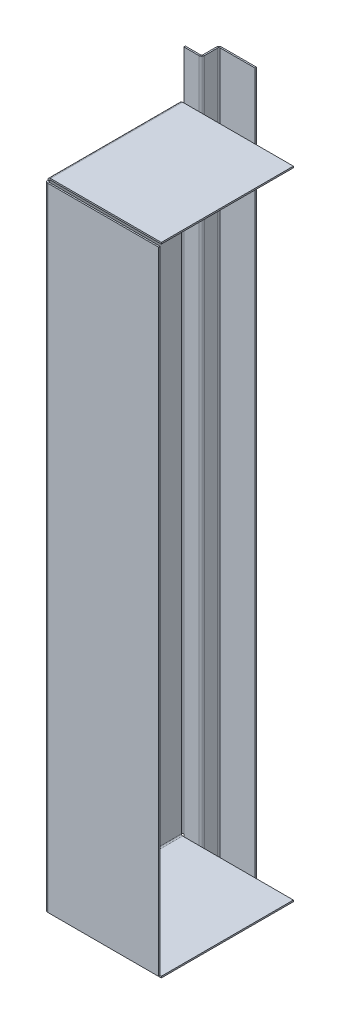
ISO-10303-21;
HEADER;
FILE_DESCRIPTION(('STEP AP214'),'2;1');
FILE_NAME('part.step','',(''),(''),'','','');
FILE_SCHEMA(('AUTOMOTIVE_DESIGN { 1 0 10303 214 1 1 1 1 }'));
ENDSEC;
DATA;
#1=APPLICATION_CONTEXT('core data for automotive mechanical design processes');
#2=APPLICATION_PROTOCOL_DEFINITION('international standard','automotive_design',2000,#1);
#3=PRODUCT_CONTEXT('',#1,'mechanical');
#4=PRODUCT('Part','Part','',(#3));
#5=PRODUCT_RELATED_PRODUCT_CATEGORY('part','',(#4));
#6=PRODUCT_DEFINITION_FORMATION('','',#4);
#7=PRODUCT_DEFINITION_CONTEXT('part definition',#1,'design');
#8=PRODUCT_DEFINITION('design','',#6,#7);
#9=PRODUCT_DEFINITION_SHAPE('','',#8);
#10=(LENGTH_UNIT() NAMED_UNIT(*) SI_UNIT(.MILLI.,.METRE.));
#11=(NAMED_UNIT(*) PLANE_ANGLE_UNIT() SI_UNIT($,.RADIAN.));
#12=(NAMED_UNIT(*) SI_UNIT($,.STERADIAN.) SOLID_ANGLE_UNIT());
#13=UNCERTAINTY_MEASURE_WITH_UNIT(LENGTH_MEASURE(1.E-05),#10,'distance_accuracy_value','');
#14=(GEOMETRIC_REPRESENTATION_CONTEXT(3) GLOBAL_UNCERTAINTY_ASSIGNED_CONTEXT((#13)) GLOBAL_UNIT_ASSIGNED_CONTEXT((#10,
#11,#12)) REPRESENTATION_CONTEXT('',''));
#15=CARTESIAN_POINT('',(0.,0.,0.));
#16=DIRECTION('',(0.,0.,1.));
#17=DIRECTION('',(1.,0.,0.));
#18=AXIS2_PLACEMENT_3D('',#15,#16,#17);
#19=CARTESIAN_POINT('',(-75.5000000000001,-184.799999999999,-123.8));
#20=DIRECTION('',(0.,1.,0.));
#21=DIRECTION('',(0.,0.,1.));
#22=AXIS2_PLACEMENT_3D('',#19,#20,#21);
#23=PLANE('',#22);
#24=DIRECTION('',(-1.,0.,0.));
#25=VECTOR('',#24,1.);
#26=CARTESIAN_POINT('',(-75.5000000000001,-184.799999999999,-121.6));
#27=LINE('',#26,#25);
#28=CARTESIAN_POINT('',(-75.5000000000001,-184.799999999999,-121.6));
#29=VERTEX_POINT('',#28);
#30=CARTESIAN_POINT('',(-76.7000000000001,-184.799999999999,-121.6));
#31=VERTEX_POINT('',#30);
#32=EDGE_CURVE('E523',#29,#31,#27,.T.);
#33=ORIENTED_EDGE('',*,*,#32,.F.);
#34=DIRECTION('',(0.,0.,-1.));
#35=VECTOR('',#34,1.);
#36=CARTESIAN_POINT('',(-75.4999999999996,-184.799999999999,3.0789209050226E-13));
#37=LINE('',#36,#35);
#38=CARTESIAN_POINT('',(-75.5000000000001,-184.799999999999,-111.));
#39=VERTEX_POINT('',#38);
#40=EDGE_CURVE('E532',#39,#29,#37,.T.);
#41=ORIENTED_EDGE('',*,*,#40,.F.);
#42=DIRECTION('',(-1.,0.,0.));
#43=VECTOR('',#42,1.);
#44=CARTESIAN_POINT('',(-76.7000000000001,-184.799999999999,-111.));
#45=LINE('',#44,#43);
#46=CARTESIAN_POINT('',(-76.7000000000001,-184.799999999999,-111.));
#47=VERTEX_POINT('',#46);
#48=EDGE_CURVE('E543',#47,#39,#45,.F.);
#49=ORIENTED_EDGE('',*,*,#48,.F.);
#50=DIRECTION('',(0.,0.,1.));
#51=VECTOR('',#50,1.);
#52=CARTESIAN_POINT('',(-76.7000000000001,-184.799999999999,-123.8));
#53=LINE('',#52,#51);
#54=EDGE_CURVE('E537',#47,#31,#53,.F.);
#55=ORIENTED_EDGE('',*,*,#54,.T.);
#56=EDGE_LOOP('',(#33,#41,#49,#55));
#57=FACE_BOUND('',#56,.T.);
#58=ADVANCED_FACE('F161',(#57),#23,.F.);
#59=CARTESIAN_POINT('',(-75.5000000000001,400.200000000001,-110.));
#60=DIRECTION('',(0.,-1.,0.));
#61=DIRECTION('',(0.,0.,-1.));
#62=AXIS2_PLACEMENT_3D('',#59,#60,#61);
#63=PLANE('',#62);
#64=DIRECTION('',(-1.,0.,0.));
#65=VECTOR('',#64,1.);
#66=CARTESIAN_POINT('',(-75.5000000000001,400.200000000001,-121.6));
#67=LINE('',#66,#65);
#68=CARTESIAN_POINT('',(-75.5000000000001,400.200000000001,-121.6));
#69=VERTEX_POINT('',#68);
#70=CARTESIAN_POINT('',(-76.7000000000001,400.200000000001,-121.6));
#71=VERTEX_POINT('',#70);
#72=EDGE_CURVE('E513',#69,#71,#67,.T.);
#73=ORIENTED_EDGE('',*,*,#72,.T.);
#74=DIRECTION('',(0.,0.,-1.));
#75=VECTOR('',#74,1.);
#76=CARTESIAN_POINT('',(-76.7000000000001,400.200000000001,-110.));
#77=LINE('',#76,#75);
#78=CARTESIAN_POINT('',(-76.7000000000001,400.200000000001,-111.));
#79=VERTEX_POINT('',#78);
#80=EDGE_CURVE('E535',#71,#79,#77,.F.);
#81=ORIENTED_EDGE('',*,*,#80,.T.);
#82=DIRECTION('',(-1.,0.,0.));
#83=VECTOR('',#82,1.);
#84=CARTESIAN_POINT('',(-75.5000000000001,400.200000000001,-111.));
#85=LINE('',#84,#83);
#86=CARTESIAN_POINT('',(-75.5000000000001,400.200000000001,-111.));
#87=VERTEX_POINT('',#86);
#88=EDGE_CURVE('E526',#79,#87,#85,.F.);
#89=ORIENTED_EDGE('',*,*,#88,.T.);
#90=DIRECTION('',(0.,0.,1.));
#91=VECTOR('',#90,1.);
#92=CARTESIAN_POINT('',(-75.4999999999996,400.200000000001,3.0789209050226E-13));
#93=LINE('',#92,#91);
#94=EDGE_CURVE('E529',#69,#87,#93,.T.);
#95=ORIENTED_EDGE('',*,*,#94,.F.);
#96=EDGE_LOOP('',(#73,#81,#89,#95));
#97=FACE_BOUND('',#96,.T.);
#98=ADVANCED_FACE('F820',(#97),#63,.F.);
#99=CARTESIAN_POINT('',(-75.4999999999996,0.,3.0789209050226E-13));
#100=DIRECTION('',(-1.,0.,0.));
#101=DIRECTION('',(0.,0.,1.));
#102=AXIS2_PLACEMENT_3D('',#99,#100,#101);
#103=PLANE('',#102);
#104=DIRECTION('',(0.,1.,0.));
#105=VECTOR('',#104,1.);
#106=CARTESIAN_POINT('',(-75.5000000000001,400.200000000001,-121.6));
#107=LINE('',#106,#105);
#108=EDGE_CURVE('E519',#69,#29,#107,.F.);
#109=ORIENTED_EDGE('',*,*,#108,.F.);
#110=ORIENTED_EDGE('',*,*,#94,.T.);
#111=DIRECTION('',(0.,-1.,0.));
#112=VECTOR('',#111,1.);
#113=CARTESIAN_POINT('',(-75.5000000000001,400.200000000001,-111.));
#114=LINE('',#113,#112);
#115=EDGE_CURVE('E540',#39,#87,#114,.F.);
#116=ORIENTED_EDGE('',*,*,#115,.F.);
#117=ORIENTED_EDGE('',*,*,#40,.T.);
#118=EDGE_LOOP('',(#109,#110,#116,#117));
#119=FACE_BOUND('',#118,.T.);
#120=ADVANCED_FACE('F826',(#119),#103,.F.);
#121=CARTESIAN_POINT('',(-76.6999999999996,0.,3.12409944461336E-13));
#122=DIRECTION('',(-1.,0.,0.));
#123=DIRECTION('',(0.,0.,1.));
#124=AXIS2_PLACEMENT_3D('',#121,#122,#123);
#125=PLANE('',#124);
#126=ORIENTED_EDGE('',*,*,#80,.F.);
#127=DIRECTION('',(0.,1.,0.));
#128=VECTOR('',#127,1.);
#129=CARTESIAN_POINT('',(-76.7000000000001,400.200000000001,-121.6));
#130=LINE('',#129,#128);
#131=EDGE_CURVE('E506',#71,#31,#130,.F.);
#132=ORIENTED_EDGE('',*,*,#131,.T.);
#133=ORIENTED_EDGE('',*,*,#54,.F.);
#134=DIRECTION('',(0.,-1.,0.));
#135=VECTOR('',#134,1.);
#136=CARTESIAN_POINT('',(-76.7000000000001,400.200000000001,-111.));
#137=LINE('',#136,#135);
#138=EDGE_CURVE('E546',#79,#47,#137,.T.);
#139=ORIENTED_EDGE('',*,*,#138,.F.);
#140=EDGE_LOOP('',(#126,#132,#133,#139));
#141=FACE_BOUND('',#140,.T.);
#142=ADVANCED_FACE('F941',(#141),#125,.T.);
#143=CARTESIAN_POINT('',(-75.5000000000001,-184.799999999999,-110.));
#144=DIRECTION('',(0.,-1.,0.));
#145=DIRECTION('',(1.,0.,0.));
#146=AXIS2_PLACEMENT_3D('',#143,#144,#145);
#147=PLANE('',#146);
#148=DIRECTION('',(1.,0.,0.));
#149=VECTOR('',#148,1.);
#150=CARTESIAN_POINT('',(-75.5000000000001,-184.799999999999,-110.));
#151=LINE('',#150,#149);
#152=CARTESIAN_POINT('',(-89.8,-184.799999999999,-110.));
#153=VERTEX_POINT('',#152);
#154=CARTESIAN_POINT('',(-77.7000000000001,-184.799999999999,-110.));
#155=VERTEX_POINT('',#154);
#156=EDGE_CURVE('E659',#153,#155,#151,.T.);
#157=ORIENTED_EDGE('',*,*,#156,.T.);
#158=DIRECTION('',(0.,0.,1.));
#159=VECTOR('',#158,1.);
#160=CARTESIAN_POINT('',(-77.7000000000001,-184.799999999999,-110.));
#161=LINE('',#160,#159);
#162=CARTESIAN_POINT('',(-77.7,-184.799999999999,-108.8));
#163=VERTEX_POINT('',#162);
#164=EDGE_CURVE('E556',#155,#163,#161,.T.);
#165=ORIENTED_EDGE('',*,*,#164,.T.);
#166=DIRECTION('',(-1.,0.,0.));
#167=VECTOR('',#166,1.);
#168=CARTESIAN_POINT('',(-4.58823021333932E-13,-184.799999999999,-108.800000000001));
#169=LINE('',#168,#167);
#170=CARTESIAN_POINT('',(-89.8,-184.799999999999,-108.8));
#171=VERTEX_POINT('',#170);
#172=EDGE_CURVE('E664',#171,#163,#169,.F.);
#173=ORIENTED_EDGE('',*,*,#172,.F.);
#174=DIRECTION('',(0.,0.,-1.));
#175=VECTOR('',#174,1.);
#176=CARTESIAN_POINT('',(-89.8,-184.799999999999,-110.));
#177=LINE('',#176,#175);
#178=EDGE_CURVE('E647',#171,#153,#177,.T.);
#179=ORIENTED_EDGE('',*,*,#178,.T.);
#180=EDGE_LOOP('',(#157,#165,#173,#179));
#181=FACE_BOUND('',#180,.T.);
#182=ADVANCED_FACE('F931',(#181),#147,.T.);
#183=CARTESIAN_POINT('',(-8.02389337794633E-13,0.,-110.000000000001));
#184=DIRECTION('',(0.,0.,-1.));
#185=DIRECTION('',(-1.,0.,0.));
#186=AXIS2_PLACEMENT_3D('',#183,#184,#185);
#187=PLANE('',#186);
#188=DIRECTION('',(-1.,0.,0.));
#189=VECTOR('',#188,1.);
#190=CARTESIAN_POINT('',(-90.8000000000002,400.200000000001,-110.));
#191=LINE('',#190,#189);
#192=CARTESIAN_POINT('',(-77.7000000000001,400.200000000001,-110.));
#193=VERTEX_POINT('',#192);
#194=CARTESIAN_POINT('',(-89.8000000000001,400.200000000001,-110.));
#195=VERTEX_POINT('',#194);
#196=EDGE_CURVE('E656',#193,#195,#191,.T.);
#197=ORIENTED_EDGE('',*,*,#196,.F.);
#198=DIRECTION('',(0.,-1.,0.));
#199=VECTOR('',#198,1.);
#200=CARTESIAN_POINT('',(-77.7000000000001,-184.799999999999,-110.));
#201=LINE('',#200,#199);
#202=EDGE_CURVE('E562',#155,#193,#201,.F.);
#203=ORIENTED_EDGE('',*,*,#202,.F.);
#204=ORIENTED_EDGE('',*,*,#156,.F.);
#205=DIRECTION('',(0.,1.,0.));
#206=VECTOR('',#205,1.);
#207=CARTESIAN_POINT('',(-89.8000000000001,0.,-110.));
#208=LINE('',#207,#206);
#209=CARTESIAN_POINT('',(-89.8,-144.799999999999,-110.));
#210=VERTEX_POINT('',#209);
#211=EDGE_CURVE('E667',#153,#210,#208,.T.);
#212=ORIENTED_EDGE('',*,*,#211,.T.);
#213=DIRECTION('',(0.,1.,0.));
#214=VECTOR('',#213,1.);
#215=CARTESIAN_POINT('',(-89.8000000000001,360.200000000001,-110.));
#216=LINE('',#215,#214);
#217=CARTESIAN_POINT('',(-89.8000000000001,360.200000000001,-110.));
#218=VERTEX_POINT('',#217);
#219=EDGE_CURVE('E685',#210,#218,#216,.T.);
#220=ORIENTED_EDGE('',*,*,#219,.T.);
#221=EDGE_CURVE('E670',#218,#195,#208,.T.);
#222=ORIENTED_EDGE('',*,*,#221,.T.);
#223=EDGE_LOOP('',(#197,#203,#204,#212,#220,#222));
#224=FACE_BOUND('',#223,.T.);
#225=ADVANCED_FACE('F927',(#224),#187,.T.);
#226=CARTESIAN_POINT('',(-7.940668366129E-13,0.,-108.800000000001));
#227=DIRECTION('',(0.,0.,-1.));
#228=DIRECTION('',(-1.,0.,0.));
#229=AXIS2_PLACEMENT_3D('',#226,#227,#228);
#230=PLANE('',#229);
#231=DIRECTION('',(0.,-1.,0.));
#232=VECTOR('',#231,1.);
#233=CARTESIAN_POINT('',(-77.7,-184.799999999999,-108.8));
#234=LINE('',#233,#232);
#235=CARTESIAN_POINT('',(-77.7000000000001,400.200000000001,-108.8));
#236=VERTEX_POINT('',#235);
#237=EDGE_CURVE('E550',#163,#236,#234,.F.);
#238=ORIENTED_EDGE('',*,*,#237,.T.);
#239=DIRECTION('',(1.,0.,0.));
#240=VECTOR('',#239,1.);
#241=CARTESIAN_POINT('',(-7.940668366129E-13,400.200000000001,-108.800000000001));
#242=LINE('',#241,#240);
#243=CARTESIAN_POINT('',(-89.8000000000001,400.200000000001,-108.8));
#244=VERTEX_POINT('',#243);
#245=EDGE_CURVE('E662',#236,#244,#242,.F.);
#246=ORIENTED_EDGE('',*,*,#245,.T.);
#247=DIRECTION('',(0.,-1.,0.));
#248=VECTOR('',#247,1.);
#249=CARTESIAN_POINT('',(-89.8,-184.799999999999,-108.8));
#250=LINE('',#249,#248);
#251=CARTESIAN_POINT('',(-89.8000000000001,360.200000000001,-108.8));
#252=VERTEX_POINT('',#251);
#253=EDGE_CURVE('E677',#252,#244,#250,.F.);
#254=ORIENTED_EDGE('',*,*,#253,.F.);
#255=DIRECTION('',(0.,1.,0.));
#256=VECTOR('',#255,1.);
#257=CARTESIAN_POINT('',(-89.8000000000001,360.200000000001,-108.8));
#258=LINE('',#257,#256);
#259=CARTESIAN_POINT('',(-89.8000000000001,-144.799999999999,-108.8));
#260=VERTEX_POINT('',#259);
#261=EDGE_CURVE('E658',#260,#252,#258,.T.);
#262=ORIENTED_EDGE('',*,*,#261,.F.);
#263=EDGE_CURVE('E674',#171,#260,#250,.F.);
#264=ORIENTED_EDGE('',*,*,#263,.F.);
#265=ORIENTED_EDGE('',*,*,#172,.T.);
#266=EDGE_LOOP('',(#238,#246,#254,#262,#264,#265));
#267=FACE_BOUND('',#266,.T.);
#268=ADVANCED_FACE('F930',(#267),#230,.F.);
#269=CARTESIAN_POINT('',(-91.9999999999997,0.,3.21031918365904E-13));
#270=DIRECTION('',(-1.,0.,0.));
#271=DIRECTION('',(0.,0.,1.));
#272=AXIS2_PLACEMENT_3D('',#269,#270,#271);
#273=PLANE('',#272);
#274=DIRECTION('',(0.,-1.,0.));
#275=VECTOR('',#274,1.);
#276=CARTESIAN_POINT('',(-92.0000000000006,-101.800000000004,-31.2999999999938));
#277=LINE('',#276,#275);
#278=CARTESIAN_POINT('',(-92.0000000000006,-101.800000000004,-31.2999999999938));
#279=VERTEX_POINT('',#278);
#280=CARTESIAN_POINT('',(-92.0000000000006,-111.800000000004,-31.2999999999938));
#281=VERTEX_POINT('',#280);
#282=EDGE_CURVE('E413',#279,#281,#277,.T.);
#283=ORIENTED_EDGE('',*,*,#282,.T.);
#284=DIRECTION('',(0.,0.,-1.));
#285=VECTOR('',#284,1.);
#286=CARTESIAN_POINT('',(-92.0000000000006,-111.800000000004,-31.2999999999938));
#287=LINE('',#286,#285);
#288=CARTESIAN_POINT('',(-91.9999999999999,-111.800000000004,-56.2999999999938));
#289=VERTEX_POINT('',#288);
#290=EDGE_CURVE('E421',#281,#289,#287,.T.);
#291=ORIENTED_EDGE('',*,*,#290,.T.);
#292=DIRECTION('',(0.,1.,0.));
#293=VECTOR('',#292,1.);
#294=CARTESIAN_POINT('',(-92.0000000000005,-111.800000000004,-56.2999999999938));
#295=LINE('',#294,#293);
#296=CARTESIAN_POINT('',(-92.0000000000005,-101.800000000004,-56.2999999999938));
#297=VERTEX_POINT('',#296);
#298=EDGE_CURVE('E176',#289,#297,#295,.T.);
#299=ORIENTED_EDGE('',*,*,#298,.T.);
#300=DIRECTION('',(0.,0.,1.));
#301=VECTOR('',#300,1.);
#302=CARTESIAN_POINT('',(-92.0000000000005,-101.800000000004,-56.2999999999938));
#303=LINE('',#302,#301);
#304=EDGE_CURVE('E418',#297,#279,#303,.T.);
#305=ORIENTED_EDGE('',*,*,#304,.T.);
#306=EDGE_LOOP('',(#283,#291,#299,#305));
#307=FACE_BOUND('',#306,.T.);
#308=CARTESIAN_POINT('',(-92.0000000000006,260.399999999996,-24.7999999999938));
#309=DIRECTION('',(1.,0.,0.));
#310=DIRECTION('',(0.,0.,-1.));
#311=AXIS2_PLACEMENT_3D('',#308,#309,#310);
#312=CIRCLE('',#311,4.09999999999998);
#313=CARTESIAN_POINT('',(-92.0000000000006,260.399999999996,-28.8999999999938));
#314=VERTEX_POINT('',#313);
#315=EDGE_CURVE('E447',#314,#314,#312,.T.);
#316=ORIENTED_EDGE('',*,*,#315,.T.);
#317=EDGE_LOOP('',(#316));
#318=FACE_BOUND('',#317,.T.);
#319=CARTESIAN_POINT('',(-92.0000000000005,260.399999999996,-62.7999999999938));
#320=DIRECTION('',(1.,0.,0.));
#321=DIRECTION('',(0.,0.,-1.));
#322=AXIS2_PLACEMENT_3D('',#319,#320,#321);
#323=CIRCLE('',#322,4.09999999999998);
#324=CARTESIAN_POINT('',(-92.0000000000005,260.399999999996,-66.8999999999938));
#325=VERTEX_POINT('',#324);
#326=EDGE_CURVE('E443',#325,#325,#323,.T.);
#327=ORIENTED_EDGE('',*,*,#326,.T.);
#328=EDGE_LOOP('',(#327));
#329=FACE_BOUND('',#328,.T.);
#330=CARTESIAN_POINT('',(-92.0000000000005,-29.8000000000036,-43.7999999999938));
#331=DIRECTION('',(1.,0.,0.));
#332=DIRECTION('',(0.,0.,-1.));
#333=AXIS2_PLACEMENT_3D('',#330,#331,#332);
#334=CIRCLE('',#333,9.99999999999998);
#335=CARTESIAN_POINT('',(-92.0000000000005,-29.8000000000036,-53.7999999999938));
#336=VERTEX_POINT('',#335);
#337=EDGE_CURVE('E428',#336,#336,#334,.T.);
#338=ORIENTED_EDGE('',*,*,#337,.T.);
#339=EDGE_LOOP('',(#338));
#340=FACE_BOUND('',#339,.T.);
#341=CARTESIAN_POINT('',(-92.0000000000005,266.649999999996,-43.7999999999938));
#342=DIRECTION('',(1.,0.,0.));
#343=DIRECTION('',(0.,0.,-1.));
#344=AXIS2_PLACEMENT_3D('',#341,#342,#343);
#345=CIRCLE('',#344,12.5);
#346=CARTESIAN_POINT('',(-92.0000000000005,266.649999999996,-56.2999999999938));
#347=VERTEX_POINT('',#346);
#348=CARTESIAN_POINT('',(-92.0000000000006,266.649999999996,-31.2999999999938));
#349=VERTEX_POINT('',#348);
#350=EDGE_CURVE('E453',#347,#349,#345,.T.);
#351=ORIENTED_EDGE('',*,*,#350,.T.);
#352=DIRECTION('',(0.,-1.,0.));
#353=VECTOR('',#352,1.);
#354=CARTESIAN_POINT('',(-92.0000000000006,266.649999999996,-31.2999999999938));
#355=LINE('',#354,#353);
#356=CARTESIAN_POINT('',(-91.9999999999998,254.149999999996,-31.2999999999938));
#357=VERTEX_POINT('',#356);
#358=EDGE_CURVE('E458',#349,#357,#355,.T.);
#359=ORIENTED_EDGE('',*,*,#358,.T.);
#360=CARTESIAN_POINT('',(-92.0000000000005,254.149999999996,-43.7999999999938));
#361=DIRECTION('',(1.,0.,0.));
#362=DIRECTION('',(0.,0.,-1.));
#363=AXIS2_PLACEMENT_3D('',#360,#361,#362);
#364=CIRCLE('',#363,12.5);
#365=CARTESIAN_POINT('',(-92.0000000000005,254.149999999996,-56.2999999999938));
#366=VERTEX_POINT('',#365);
#367=EDGE_CURVE('E184',#357,#366,#364,.T.);
#368=ORIENTED_EDGE('',*,*,#367,.T.);
#369=DIRECTION('',(0.,1.,0.));
#370=VECTOR('',#369,1.);
#371=CARTESIAN_POINT('',(-92.0000000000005,254.149999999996,-56.2999999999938));
#372=LINE('',#371,#370);
#373=EDGE_CURVE('E462',#366,#347,#372,.T.);
#374=ORIENTED_EDGE('',*,*,#373,.T.);
#375=EDGE_LOOP('',(#351,#359,#368,#374));
#376=FACE_BOUND('',#375,.T.);
#377=CARTESIAN_POINT('',(-92.0000000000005,-29.8000000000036,-62.7999999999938));
#378=DIRECTION('',(1.,0.,0.));
#379=DIRECTION('',(0.,0.,-1.));
#380=AXIS2_PLACEMENT_3D('',#377,#378,#379);
#381=CIRCLE('',#380,3.99999999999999);
#382=CARTESIAN_POINT('',(-92.0000000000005,-29.8000000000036,-66.7999999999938));
#383=VERTEX_POINT('',#382);
#384=EDGE_CURVE('E450',#383,#383,#381,.T.);
#385=ORIENTED_EDGE('',*,*,#384,.T.);
#386=EDGE_LOOP('',(#385));
#387=FACE_BOUND('',#386,.T.);
#388=CARTESIAN_POINT('',(-92.0000000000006,-29.8000000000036,-24.7999999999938));
#389=DIRECTION('',(1.,0.,0.));
#390=DIRECTION('',(0.,0.,-1.));
#391=AXIS2_PLACEMENT_3D('',#388,#389,#390);
#392=CIRCLE('',#391,3.99999999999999);
#393=CARTESIAN_POINT('',(-92.0000000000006,-29.8000000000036,-28.7999999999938));
#394=VERTEX_POINT('',#393);
#395=EDGE_CURVE('E446',#394,#394,#392,.T.);
#396=ORIENTED_EDGE('',*,*,#395,.T.);
#397=EDGE_LOOP('',(#396));
#398=FACE_BOUND('',#397,.T.);
#399=DIRECTION('',(0.,0.,1.));
#400=VECTOR('',#399,1.);
#401=CARTESIAN_POINT('',(-91.9999999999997,360.200000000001,-1.2));
#402=LINE('',#401,#400);
#403=CARTESIAN_POINT('',(-92.0000000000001,360.200000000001,-107.8));
#404=VERTEX_POINT('',#403);
#405=CARTESIAN_POINT('',(-91.9999999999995,360.200000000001,-2.20000000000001));
#406=VERTEX_POINT('',#405);
#407=EDGE_CURVE('E710',#404,#406,#402,.T.);
#408=ORIENTED_EDGE('',*,*,#407,.F.);
#409=DIRECTION('',(0.,1.,0.));
#410=VECTOR('',#409,1.);
#411=CARTESIAN_POINT('',(-92.0000000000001,360.200000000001,-107.8));
#412=LINE('',#411,#410);
#413=CARTESIAN_POINT('',(-92.0000000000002,-144.799999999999,-107.8));
#414=VERTEX_POINT('',#413);
#415=EDGE_CURVE('E679',#404,#414,#412,.F.);
#416=ORIENTED_EDGE('',*,*,#415,.T.);
#417=DIRECTION('',(0.,0.,-1.));
#418=VECTOR('',#417,1.);
#419=CARTESIAN_POINT('',(-92.0000000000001,-144.799999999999,-110.));
#420=LINE('',#419,#418);
#421=CARTESIAN_POINT('',(-91.9999999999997,-144.799999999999,-2.20000000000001));
#422=VERTEX_POINT('',#421);
#423=EDGE_CURVE('E714',#422,#414,#420,.T.);
#424=ORIENTED_EDGE('',*,*,#423,.F.);
#425=DIRECTION('',(0.,1.,0.));
#426=VECTOR('',#425,1.);
#427=CARTESIAN_POINT('',(-91.9999999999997,0.,-2.20000000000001));
#428=LINE('',#427,#426);
#429=EDGE_CURVE('E722',#422,#406,#428,.T.);
#430=ORIENTED_EDGE('',*,*,#429,.T.);
#431=EDGE_LOOP('',(#408,#416,#424,#430));
#432=FACE_BOUND('',#431,.T.);
#433=ADVANCED_FACE('F425',(#307,#318,#329,#340,#376,#387,#398,#432),#273,.T.);
#434=CARTESIAN_POINT('',(-90.7999999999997,0.,3.16842140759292E-13));
#435=DIRECTION('',(-1.,0.,0.));
#436=DIRECTION('',(0.,0.,1.));
#437=AXIS2_PLACEMENT_3D('',#434,#435,#436);
#438=PLANE('',#437);
#439=DIRECTION('',(0.,0.,1.));
#440=VECTOR('',#439,1.);
#441=CARTESIAN_POINT('',(-90.7999999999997,-111.800000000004,3.16842140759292E-13));
#442=LINE('',#441,#440);
#443=CARTESIAN_POINT('',(-90.7999999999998,-111.800000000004,-56.2999999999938));
#444=VERTEX_POINT('',#443);
#445=CARTESIAN_POINT('',(-90.7999999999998,-111.800000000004,-31.2999999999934));
#446=VERTEX_POINT('',#445);
#447=EDGE_CURVE('E793',#444,#446,#442,.T.);
#448=ORIENTED_EDGE('',*,*,#447,.T.);
#449=DIRECTION('',(0.,1.,0.));
#450=VECTOR('',#449,1.);
#451=CARTESIAN_POINT('',(-90.7999999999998,0.,-31.2999999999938));
#452=LINE('',#451,#450);
#453=CARTESIAN_POINT('',(-90.7999999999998,-101.800000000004,-31.2999999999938));
#454=VERTEX_POINT('',#453);
#455=EDGE_CURVE('E13',#446,#454,#452,.T.);
#456=ORIENTED_EDGE('',*,*,#455,.T.);
#457=DIRECTION('',(0.,0.,-1.));
#458=VECTOR('',#457,1.);
#459=CARTESIAN_POINT('',(-90.7999999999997,-101.800000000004,3.16842140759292E-13));
#460=LINE('',#459,#458);
#461=CARTESIAN_POINT('',(-90.7999999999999,-101.800000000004,-56.2999999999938));
#462=VERTEX_POINT('',#461);
#463=EDGE_CURVE('E169',#454,#462,#460,.T.);
#464=ORIENTED_EDGE('',*,*,#463,.T.);
#465=DIRECTION('',(0.,-1.,0.));
#466=VECTOR('',#465,1.);
#467=CARTESIAN_POINT('',(-90.7999999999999,0.,-56.2999999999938));
#468=LINE('',#467,#466);
#469=EDGE_CURVE('E802',#462,#444,#468,.T.);
#470=ORIENTED_EDGE('',*,*,#469,.T.);
#471=EDGE_LOOP('',(#448,#456,#464,#470));
#472=FACE_BOUND('',#471,.T.);
#473=CARTESIAN_POINT('',(-90.7999999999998,260.399999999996,-24.7999999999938));
#474=DIRECTION('',(-1.,0.,0.));
#475=DIRECTION('',(0.,0.,1.));
#476=AXIS2_PLACEMENT_3D('',#473,#474,#475);
#477=CIRCLE('',#476,4.09999999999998);
#478=CARTESIAN_POINT('',(-90.7999999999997,260.399999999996,-20.6999999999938));
#479=VERTEX_POINT('',#478);
#480=EDGE_CURVE('E505',#479,#479,#477,.T.);
#481=ORIENTED_EDGE('',*,*,#480,.T.);
#482=EDGE_LOOP('',(#481));
#483=FACE_BOUND('',#482,.T.);
#484=CARTESIAN_POINT('',(-90.7999999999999,260.399999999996,-62.7999999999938));
#485=DIRECTION('',(-1.,0.,0.));
#486=DIRECTION('',(0.,0.,1.));
#487=AXIS2_PLACEMENT_3D('',#484,#485,#486);
#488=CIRCLE('',#487,4.09999999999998);
#489=CARTESIAN_POINT('',(-90.7999999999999,260.399999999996,-58.6999999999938));
#490=VERTEX_POINT('',#489);
#491=EDGE_CURVE('E796',#490,#490,#488,.T.);
#492=ORIENTED_EDGE('',*,*,#491,.T.);
#493=EDGE_LOOP('',(#492));
#494=FACE_BOUND('',#493,.T.);
#495=CARTESIAN_POINT('',(-90.7999999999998,-29.8000000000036,-43.7999999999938));
#496=DIRECTION('',(-1.,0.,0.));
#497=DIRECTION('',(0.,0.,1.));
#498=AXIS2_PLACEMENT_3D('',#495,#496,#497);
#499=CIRCLE('',#498,9.99999999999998);
#500=CARTESIAN_POINT('',(-90.7999999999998,-29.8000000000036,-33.7999999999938));
#501=VERTEX_POINT('',#500);
#502=EDGE_CURVE('E781',#501,#501,#499,.T.);
#503=ORIENTED_EDGE('',*,*,#502,.T.);
#504=EDGE_LOOP('',(#503));
#505=FACE_BOUND('',#504,.T.);
#506=DIRECTION('',(0.,1.,0.));
#507=VECTOR('',#506,1.);
#508=CARTESIAN_POINT('',(-90.7999999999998,1.38999922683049E-13,-31.299999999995));
#509=LINE('',#508,#507);
#510=CARTESIAN_POINT('',(-90.7999999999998,254.149999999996,-31.2999999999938));
#511=VERTEX_POINT('',#510);
#512=CARTESIAN_POINT('',(-90.7999999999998,266.649999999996,-31.2999999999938));
#513=VERTEX_POINT('',#512);
#514=EDGE_CURVE('E774',#511,#513,#509,.T.);
#515=ORIENTED_EDGE('',*,*,#514,.T.);
#516=CARTESIAN_POINT('',(-90.7999999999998,266.649999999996,-43.7999999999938));
#517=DIRECTION('',(-1.,0.,0.));
#518=DIRECTION('',(0.,0.,1.));
#519=AXIS2_PLACEMENT_3D('',#516,#517,#518);
#520=CIRCLE('',#519,12.5);
#521=CARTESIAN_POINT('',(-90.7999999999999,266.649999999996,-56.2999999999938));
#522=VERTEX_POINT('',#521);
#523=EDGE_CURVE('E790',#513,#522,#520,.T.);
#524=ORIENTED_EDGE('',*,*,#523,.T.);
#525=DIRECTION('',(0.,-1.,0.));
#526=VECTOR('',#525,1.);
#527=CARTESIAN_POINT('',(-90.7999999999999,0.,-56.2999999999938));
#528=LINE('',#527,#526);
#529=CARTESIAN_POINT('',(-90.7999999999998,254.149999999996,-56.2999999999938));
#530=VERTEX_POINT('',#529);
#531=EDGE_CURVE('E787',#522,#530,#528,.T.);
#532=ORIENTED_EDGE('',*,*,#531,.T.);
#533=CARTESIAN_POINT('',(-90.7999999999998,254.149999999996,-43.7999999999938));
#534=DIRECTION('',(-1.,0.,0.));
#535=DIRECTION('',(0.,0.,1.));
#536=AXIS2_PLACEMENT_3D('',#533,#534,#535);
#537=CIRCLE('',#536,12.5);
#538=EDGE_CURVE('E784',#530,#511,#537,.T.);
#539=ORIENTED_EDGE('',*,*,#538,.T.);
#540=EDGE_LOOP('',(#515,#524,#532,#539));
#541=FACE_BOUND('',#540,.T.);
#542=CARTESIAN_POINT('',(-90.7999999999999,-29.8000000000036,-62.7999999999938));
#543=DIRECTION('',(-1.,0.,0.));
#544=DIRECTION('',(0.,0.,1.));
#545=AXIS2_PLACEMENT_3D('',#542,#543,#544);
#546=CIRCLE('',#545,3.99999999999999);
#547=CARTESIAN_POINT('',(-90.7999999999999,-29.8000000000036,-58.7999999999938));
#548=VERTEX_POINT('',#547);
#549=EDGE_CURVE('E778',#548,#548,#546,.T.);
#550=ORIENTED_EDGE('',*,*,#549,.T.);
#551=EDGE_LOOP('',(#550));
#552=FACE_BOUND('',#551,.T.);
#553=CARTESIAN_POINT('',(-90.7999999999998,-29.8000000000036,-24.7999999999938));
#554=DIRECTION('',(-1.,0.,0.));
#555=DIRECTION('',(0.,0.,1.));
#556=AXIS2_PLACEMENT_3D('',#553,#554,#555);
#557=CIRCLE('',#556,3.99999999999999);
#558=CARTESIAN_POINT('',(-90.7999999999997,-29.8000000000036,-20.7999999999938));
#559=VERTEX_POINT('',#558);
#560=EDGE_CURVE('E438',#559,#559,#557,.T.);
#561=ORIENTED_EDGE('',*,*,#560,.T.);
#562=EDGE_LOOP('',(#561));
#563=FACE_BOUND('',#562,.T.);
#564=DIRECTION('',(0.,1.,0.));
#565=VECTOR('',#564,1.);
#566=CARTESIAN_POINT('',(-90.8000000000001,360.200000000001,-107.8));
#567=LINE('',#566,#565);
#568=CARTESIAN_POINT('',(-90.8000000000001,360.200000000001,-107.8));
#569=VERTEX_POINT('',#568);
#570=CARTESIAN_POINT('',(-90.8000000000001,-144.799999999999,-107.8));
#571=VERTEX_POINT('',#570);
#572=EDGE_CURVE('E693',#569,#571,#567,.F.);
#573=ORIENTED_EDGE('',*,*,#572,.F.);
#574=DIRECTION('',(0.,0.,-1.));
#575=VECTOR('',#574,1.);
#576=CARTESIAN_POINT('',(-90.7999999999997,360.200000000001,3.16842140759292E-13));
#577=LINE('',#576,#575);
#578=CARTESIAN_POINT('',(-90.7999999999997,360.200000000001,-2.20000000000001));
#579=VERTEX_POINT('',#578);
#580=EDGE_CURVE('E717',#569,#579,#577,.F.);
#581=ORIENTED_EDGE('',*,*,#580,.T.);
#582=DIRECTION('',(0.,-1.,0.));
#583=VECTOR('',#582,1.);
#584=CARTESIAN_POINT('',(-90.7999999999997,-144.799999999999,-2.20000000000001));
#585=LINE('',#584,#583);
#586=CARTESIAN_POINT('',(-90.7999999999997,-144.799999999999,-2.20000000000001));
#587=VERTEX_POINT('',#586);
#588=EDGE_CURVE('E727',#587,#579,#585,.F.);
#589=ORIENTED_EDGE('',*,*,#588,.F.);
#590=DIRECTION('',(0.,0.,1.));
#591=VECTOR('',#590,1.);
#592=CARTESIAN_POINT('',(-90.7999999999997,-144.799999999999,3.16842140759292E-13));
#593=LINE('',#592,#591);
#594=EDGE_CURVE('E719',#587,#571,#593,.F.);
#595=ORIENTED_EDGE('',*,*,#594,.T.);
#596=EDGE_LOOP('',(#573,#581,#589,#595));
#597=FACE_BOUND('',#596,.T.);
#598=ADVANCED_FACE('F806',(#472,#483,#494,#505,#541,#552,#563,#597),#438,.F.);
#599=CARTESIAN_POINT('',(-1.19999999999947,360.200000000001,-1.2));
#600=DIRECTION('',(0.,1.,0.));
#601=DIRECTION('',(0.,0.,1.));
#602=AXIS2_PLACEMENT_3D('',#599,#600,#601);
#603=PLANE('',#602);
#604=DIRECTION('',(-1.,0.,0.));
#605=VECTOR('',#604,1.);
#606=CARTESIAN_POINT('',(-1.19999999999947,360.200000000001,-1.2));
#607=LINE('',#606,#605);
#608=CARTESIAN_POINT('',(-1.19999999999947,360.200000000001,-1.2));
#609=VERTEX_POINT('',#608);
#610=CARTESIAN_POINT('',(-89.7999999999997,360.200000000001,-1.20000000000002));
#611=VERTEX_POINT('',#610);
#612=EDGE_CURVE('E758',#609,#611,#607,.T.);
#613=ORIENTED_EDGE('',*,*,#612,.T.);
#614=DIRECTION('',(0.,0.,1.));
#615=VECTOR('',#614,1.);
#616=CARTESIAN_POINT('',(-89.7999999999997,360.200000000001,-1.20000000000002));
#617=LINE('',#616,#615);
#618=CARTESIAN_POINT('',(-89.7999999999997,360.200000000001,0.));
#619=VERTEX_POINT('',#618);
#620=EDGE_CURVE('E739',#611,#619,#617,.T.);
#621=ORIENTED_EDGE('',*,*,#620,.T.);
#622=DIRECTION('',(-1.,0.,0.));
#623=VECTOR('',#622,1.);
#624=CARTESIAN_POINT('',(-1.19999999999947,360.200000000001,0.));
#625=LINE('',#624,#623);
#626=CARTESIAN_POINT('',(-1.19999999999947,360.200000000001,0.));
#627=VERTEX_POINT('',#626);
#628=EDGE_CURVE('E767',#627,#619,#625,.T.);
#629=ORIENTED_EDGE('',*,*,#628,.F.);
#630=DIRECTION('',(0.,0.,1.));
#631=VECTOR('',#630,1.);
#632=CARTESIAN_POINT('',(-1.19999999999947,360.200000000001,-1.2));
#633=LINE('',#632,#631);
#634=EDGE_CURVE('E764',#609,#627,#633,.T.);
#635=ORIENTED_EDGE('',*,*,#634,.F.);
#636=EDGE_LOOP('',(#613,#621,#629,#635));
#637=FACE_BOUND('',#636,.T.);
#638=ADVANCED_FACE('F964',(#637),#603,.T.);
#639=CARTESIAN_POINT('',(0.,0.,-1.2));
#640=DIRECTION('',(0.,0.,1.));
#641=DIRECTION('',(1.,0.,0.));
#642=AXIS2_PLACEMENT_3D('',#639,#640,#641);
#643=PLANE('',#642);
#644=DIRECTION('',(0.,1.,0.));
#645=VECTOR('',#644,1.);
#646=CARTESIAN_POINT('',(-89.7999999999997,360.200000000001,-1.20000000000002));
#647=LINE('',#646,#645);
#648=CARTESIAN_POINT('',(-89.7999999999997,-144.799999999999,-1.20000000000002));
#649=VERTEX_POINT('',#648);
#650=EDGE_CURVE('E745',#611,#649,#647,.F.);
#651=ORIENTED_EDGE('',*,*,#650,.F.);
#652=ORIENTED_EDGE('',*,*,#612,.F.);
#653=DIRECTION('',(0.,1.,0.));
#654=VECTOR('',#653,1.);
#655=CARTESIAN_POINT('',(-1.19999999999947,-144.799999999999,-1.2));
#656=LINE('',#655,#654);
#657=CARTESIAN_POINT('',(-1.19999999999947,-144.799999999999,-1.2));
#658=VERTEX_POINT('',#657);
#659=EDGE_CURVE('E755',#658,#609,#656,.T.);
#660=ORIENTED_EDGE('',*,*,#659,.F.);
#661=DIRECTION('',(1.,0.,0.));
#662=VECTOR('',#661,1.);
#663=CARTESIAN_POINT('',(-1.19999999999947,-144.799999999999,-1.2));
#664=LINE('',#663,#662);
#665=EDGE_CURVE('E762',#649,#658,#664,.T.);
#666=ORIENTED_EDGE('',*,*,#665,.F.);
#667=EDGE_LOOP('',(#651,#652,#660,#666));
#668=FACE_BOUND('',#667,.T.);
#669=ADVANCED_FACE('F981',(#668),#643,.F.);
#670=CARTESIAN_POINT('',(0.,0.,0.));
#671=DIRECTION('',(0.,0.,1.));
#672=DIRECTION('',(1.,0.,0.));
#673=AXIS2_PLACEMENT_3D('',#670,#671,#672);
#674=PLANE('',#673);
#675=ORIENTED_EDGE('',*,*,#628,.T.);
#676=DIRECTION('',(0.,1.,0.));
#677=VECTOR('',#676,1.);
#678=CARTESIAN_POINT('',(-89.7999999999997,360.200000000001,0.));
#679=LINE('',#678,#677);
#680=CARTESIAN_POINT('',(-89.7999999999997,-144.799999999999,0.));
#681=VERTEX_POINT('',#680);
#682=EDGE_CURVE('E732',#619,#681,#679,.F.);
#683=ORIENTED_EDGE('',*,*,#682,.T.);
#684=DIRECTION('',(1.,0.,0.));
#685=VECTOR('',#684,1.);
#686=CARTESIAN_POINT('',(-1.19999999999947,-144.799999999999,0.));
#687=LINE('',#686,#685);
#688=CARTESIAN_POINT('',(-1.19999999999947,-144.799999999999,0.));
#689=VERTEX_POINT('',#688);
#690=EDGE_CURVE('E759',#681,#689,#687,.T.);
#691=ORIENTED_EDGE('',*,*,#690,.T.);
#692=DIRECTION('',(0.,1.,0.));
#693=VECTOR('',#692,1.);
#694=CARTESIAN_POINT('',(-1.19999999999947,-144.799999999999,0.));
#695=LINE('',#694,#693);
#696=EDGE_CURVE('E752',#689,#627,#695,.T.);
#697=ORIENTED_EDGE('',*,*,#696,.T.);
#698=EDGE_LOOP('',(#675,#683,#691,#697));
#699=FACE_BOUND('',#698,.T.);
#700=ADVANCED_FACE('F984',(#699),#674,.T.);
#701=CARTESIAN_POINT('',(-1.19999999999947,-144.799999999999,-1.2));
#702=DIRECTION('',(1.,0.,0.));
#703=DIRECTION('',(0.,0.,-1.));
#704=AXIS2_PLACEMENT_3D('',#701,#702,#703);
#705=PLANE('',#704);
#706=ORIENTED_EDGE('',*,*,#696,.F.);
#707=DIRECTION('',(0.,0.,1.));
#708=VECTOR('',#707,1.);
#709=CARTESIAN_POINT('',(-1.19999999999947,-144.799999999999,-1.2));
#710=LINE('',#709,#708);
#711=EDGE_CURVE('E771',#658,#689,#710,.T.);
#712=ORIENTED_EDGE('',*,*,#711,.F.);
#713=ORIENTED_EDGE('',*,*,#659,.T.);
#714=ORIENTED_EDGE('',*,*,#634,.T.);
#715=EDGE_LOOP('',(#706,#712,#713,#714));
#716=FACE_BOUND('',#715,.T.);
#717=ADVANCED_FACE('F163',(#716),#705,.T.);
#718=CARTESIAN_POINT('',(-1.19999999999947,-144.799999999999,-1.2));
#719=DIRECTION('',(0.,-1.,0.));
#720=DIRECTION('',(0.,0.,-1.));
#721=AXIS2_PLACEMENT_3D('',#718,#719,#720);
#722=PLANE('',#721);
#723=DIRECTION('',(0.,0.,1.));
#724=VECTOR('',#723,1.);
#725=CARTESIAN_POINT('',(-89.7999999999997,-144.799999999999,-1.20000000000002));
#726=LINE('',#725,#724);
#727=EDGE_CURVE('E749',#649,#681,#726,.T.);
#728=ORIENTED_EDGE('',*,*,#727,.F.);
#729=ORIENTED_EDGE('',*,*,#665,.T.);
#730=ORIENTED_EDGE('',*,*,#711,.T.);
#731=ORIENTED_EDGE('',*,*,#690,.F.);
#732=EDGE_LOOP('',(#728,#729,#730,#731));
#733=FACE_BOUND('',#732,.T.);
#734=ADVANCED_FACE('F976',(#733),#722,.T.);
#735=CARTESIAN_POINT('',(-89.7999999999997,-144.799999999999,-2.20000000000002));
#736=DIRECTION('',(0.,-1.,0.));
#737=DIRECTION('',(0.,0.,-1.));
#738=AXIS2_PLACEMENT_3D('',#735,#736,#737);
#739=PLANE('',#738);
#740=DIRECTION('',(-1.,0.,0.));
#741=VECTOR('',#740,1.);
#742=CARTESIAN_POINT('',(-91.9999999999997,-144.799999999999,-2.20000000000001));
#743=LINE('',#742,#741);
#744=EDGE_CURVE('E707',#587,#422,#743,.T.);
#745=ORIENTED_EDGE('',*,*,#744,.F.);
#746=CARTESIAN_POINT('',(-89.7999999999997,-144.799999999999,-2.20000000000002));
#747=DIRECTION('',(0.,1.,0.));
#748=DIRECTION('',(0.,0.,1.));
#749=AXIS2_PLACEMENT_3D('',#746,#747,#748);
#750=CIRCLE('',#749,1.);
#751=EDGE_CURVE('E742',#649,#587,#750,.F.);
#752=ORIENTED_EDGE('',*,*,#751,.F.);
#753=ORIENTED_EDGE('',*,*,#727,.T.);
#754=CARTESIAN_POINT('',(-89.7999999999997,-144.799999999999,-2.20000000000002));
#755=DIRECTION('',(0.,1.,0.));
#756=DIRECTION('',(0.,0.,1.));
#757=AXIS2_PLACEMENT_3D('',#754,#755,#756);
#758=CIRCLE('',#757,2.2);
#759=EDGE_CURVE('E735',#681,#422,#758,.F.);
#760=ORIENTED_EDGE('',*,*,#759,.T.);
#761=EDGE_LOOP('',(#745,#752,#753,#760));
#762=FACE_BOUND('',#761,.T.);
#763=ADVANCED_FACE('F973',(#762),#739,.T.);
#764=CARTESIAN_POINT('',(-89.7999999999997,360.200000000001,-2.20000000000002));
#765=DIRECTION('',(0.,-1.,0.));
#766=DIRECTION('',(0.,0.,-1.));
#767=AXIS2_PLACEMENT_3D('',#764,#765,#766);
#768=PLANE('',#767);
#769=CARTESIAN_POINT('',(-89.7999999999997,360.200000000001,-2.20000000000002));
#770=DIRECTION('',(0.,1.,0.));
#771=DIRECTION('',(0.,0.,1.));
#772=AXIS2_PLACEMENT_3D('',#769,#770,#771);
#773=CIRCLE('',#772,1.);
#774=EDGE_CURVE('E713',#579,#611,#773,.T.);
#775=ORIENTED_EDGE('',*,*,#774,.F.);
#776=DIRECTION('',(-1.,0.,0.));
#777=VECTOR('',#776,1.);
#778=CARTESIAN_POINT('',(-90.7999999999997,360.200000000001,-2.20000000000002));
#779=LINE('',#778,#777);
#780=EDGE_CURVE('E724',#579,#406,#779,.T.);
#781=ORIENTED_EDGE('',*,*,#780,.T.);
#782=CARTESIAN_POINT('',(-89.7999999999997,360.200000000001,-2.20000000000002));
#783=DIRECTION('',(0.,1.,0.));
#784=DIRECTION('',(0.,0.,1.));
#785=AXIS2_PLACEMENT_3D('',#782,#783,#784);
#786=CIRCLE('',#785,2.2);
#787=EDGE_CURVE('E736',#406,#619,#786,.T.);
#788=ORIENTED_EDGE('',*,*,#787,.T.);
#789=ORIENTED_EDGE('',*,*,#620,.F.);
#790=EDGE_LOOP('',(#775,#781,#788,#789));
#791=FACE_BOUND('',#790,.T.);
#792=ADVANCED_FACE('F968',(#791),#768,.F.);
#793=CARTESIAN_POINT('',(-89.7999999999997,360.200000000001,-2.20000000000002));
#794=DIRECTION('',(0.,1.,0.));
#795=DIRECTION('',(-1.,0.,0.));
#796=AXIS2_PLACEMENT_3D('',#793,#794,#795);
#797=CYLINDRICAL_SURFACE('',#796,2.2);
#798=ORIENTED_EDGE('',*,*,#682,.F.);
#799=ORIENTED_EDGE('',*,*,#787,.F.);
#800=ORIENTED_EDGE('',*,*,#429,.F.);
#801=ORIENTED_EDGE('',*,*,#759,.F.);
#802=EDGE_LOOP('',(#798,#799,#800,#801));
#803=FACE_BOUND('',#802,.T.);
#804=ADVANCED_FACE('F965',(#803),#797,.T.);
#805=CARTESIAN_POINT('',(-89.7999999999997,360.200000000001,-2.20000000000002));
#806=DIRECTION('',(0.,1.,0.));
#807=DIRECTION('',(-1.,0.,0.));
#808=AXIS2_PLACEMENT_3D('',#805,#806,#807);
#809=CYLINDRICAL_SURFACE('',#808,1.);
#810=ORIENTED_EDGE('',*,*,#650,.T.);
#811=ORIENTED_EDGE('',*,*,#751,.T.);
#812=ORIENTED_EDGE('',*,*,#588,.T.);
#813=ORIENTED_EDGE('',*,*,#774,.T.);
#814=EDGE_LOOP('',(#810,#811,#812,#813));
#815=FACE_BOUND('',#814,.T.);
#816=ADVANCED_FACE('F955',(#815),#809,.F.);
#817=CARTESIAN_POINT('',(-89.8000000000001,-144.799999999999,-107.8));
#818=DIRECTION('',(0.,-1.,0.));
#819=DIRECTION('',(0.,0.,-1.));
#820=AXIS2_PLACEMENT_3D('',#817,#818,#819);
#821=PLANE('',#820);
#822=DIRECTION('',(0.,0.,-1.));
#823=VECTOR('',#822,1.);
#824=CARTESIAN_POINT('',(-89.8000000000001,-144.799999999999,-108.8));
#825=LINE('',#824,#823);
#826=EDGE_CURVE('E702',#260,#210,#825,.T.);
#827=ORIENTED_EDGE('',*,*,#826,.F.);
#828=CARTESIAN_POINT('',(-89.8000000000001,-144.799999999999,-107.8));
#829=DIRECTION('',(0.,1.,0.));
#830=DIRECTION('',(0.,0.,1.));
#831=AXIS2_PLACEMENT_3D('',#828,#829,#830);
#832=CIRCLE('',#831,1.);
#833=EDGE_CURVE('E688',#571,#260,#832,.F.);
#834=ORIENTED_EDGE('',*,*,#833,.F.);
#835=DIRECTION('',(-1.,0.,0.));
#836=VECTOR('',#835,1.);
#837=CARTESIAN_POINT('',(-90.8000000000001,-144.799999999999,-107.8));
#838=LINE('',#837,#836);
#839=EDGE_CURVE('E699',#571,#414,#838,.T.);
#840=ORIENTED_EDGE('',*,*,#839,.T.);
#841=CARTESIAN_POINT('',(-89.8000000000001,-144.799999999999,-107.8));
#842=DIRECTION('',(0.,1.,0.));
#843=DIRECTION('',(0.,0.,1.));
#844=AXIS2_PLACEMENT_3D('',#841,#842,#843);
#845=CIRCLE('',#844,2.2);
#846=EDGE_CURVE('E681',#414,#210,#845,.F.);
#847=ORIENTED_EDGE('',*,*,#846,.T.);
#848=EDGE_LOOP('',(#827,#834,#840,#847));
#849=FACE_BOUND('',#848,.T.);
#850=ADVANCED_FACE('F952',(#849),#821,.T.);
#851=CARTESIAN_POINT('',(-89.8000000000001,360.200000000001,-107.8));
#852=DIRECTION('',(0.,-1.,0.));
#853=DIRECTION('',(0.,0.,-1.));
#854=AXIS2_PLACEMENT_3D('',#851,#852,#853);
#855=PLANE('',#854);
#856=CARTESIAN_POINT('',(-89.8000000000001,360.200000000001,-107.8));
#857=DIRECTION('',(0.,1.,0.));
#858=DIRECTION('',(0.,0.,1.));
#859=AXIS2_PLACEMENT_3D('',#856,#857,#858);
#860=CIRCLE('',#859,1.);
#861=EDGE_CURVE('E695',#252,#569,#860,.T.);
#862=ORIENTED_EDGE('',*,*,#861,.F.);
#863=DIRECTION('',(0.,0.,-1.));
#864=VECTOR('',#863,1.);
#865=CARTESIAN_POINT('',(-89.8000000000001,360.200000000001,-108.8));
#866=LINE('',#865,#864);
#867=EDGE_CURVE('E705',#252,#218,#866,.T.);
#868=ORIENTED_EDGE('',*,*,#867,.T.);
#869=CARTESIAN_POINT('',(-89.8000000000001,360.200000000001,-107.8));
#870=DIRECTION('',(0.,1.,0.));
#871=DIRECTION('',(0.,0.,1.));
#872=AXIS2_PLACEMENT_3D('',#869,#870,#871);
#873=CIRCLE('',#872,2.2);
#874=EDGE_CURVE('E682',#218,#404,#873,.T.);
#875=ORIENTED_EDGE('',*,*,#874,.T.);
#876=DIRECTION('',(-1.,0.,0.));
#877=VECTOR('',#876,1.);
#878=CARTESIAN_POINT('',(-90.8000000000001,360.200000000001,-107.8));
#879=LINE('',#878,#877);
#880=EDGE_CURVE('E684',#569,#404,#879,.T.);
#881=ORIENTED_EDGE('',*,*,#880,.F.);
#882=EDGE_LOOP('',(#862,#868,#875,#881));
#883=FACE_BOUND('',#882,.T.);
#884=ADVANCED_FACE('F947',(#883),#855,.F.);
#885=CARTESIAN_POINT('',(-89.8000000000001,360.200000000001,-107.8));
#886=DIRECTION('',(0.,1.,0.));
#887=DIRECTION('',(0.,0.,-1.));
#888=AXIS2_PLACEMENT_3D('',#885,#886,#887);
#889=CYLINDRICAL_SURFACE('',#888,2.2);
#890=ORIENTED_EDGE('',*,*,#415,.F.);
#891=ORIENTED_EDGE('',*,*,#874,.F.);
#892=ORIENTED_EDGE('',*,*,#219,.F.);
#893=ORIENTED_EDGE('',*,*,#846,.F.);
#894=EDGE_LOOP('',(#890,#891,#892,#893));
#895=FACE_BOUND('',#894,.T.);
#896=ADVANCED_FACE('F943',(#895),#889,.T.);
#897=CARTESIAN_POINT('',(-89.8000000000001,360.200000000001,-107.8));
#898=DIRECTION('',(0.,1.,0.));
#899=DIRECTION('',(0.,0.,-1.));
#900=AXIS2_PLACEMENT_3D('',#897,#898,#899);
#901=CYLINDRICAL_SURFACE('',#900,1.);
#902=ORIENTED_EDGE('',*,*,#572,.T.);
#903=ORIENTED_EDGE('',*,*,#833,.T.);
#904=ORIENTED_EDGE('',*,*,#261,.T.);
#905=ORIENTED_EDGE('',*,*,#861,.T.);
#906=EDGE_LOOP('',(#902,#903,#904,#905));
#907=FACE_BOUND('',#906,.T.);
#908=ADVANCED_FACE('F946',(#907),#901,.F.);
#909=CARTESIAN_POINT('',(-89.8,-184.799999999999,-108.8));
#910=DIRECTION('',(-1.,0.,0.));
#911=DIRECTION('',(0.,-1.,0.));
#912=AXIS2_PLACEMENT_3D('',#909,#910,#911);
#913=PLANE('',#912);
#914=ORIENTED_EDGE('',*,*,#867,.F.);
#915=ORIENTED_EDGE('',*,*,#253,.T.);
#916=DIRECTION('',(0.,0.,-1.));
#917=VECTOR('',#916,1.);
#918=CARTESIAN_POINT('',(-89.8000000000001,400.200000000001,-108.8));
#919=LINE('',#918,#917);
#920=EDGE_CURVE('E671',#244,#195,#919,.T.);
#921=ORIENTED_EDGE('',*,*,#920,.T.);
#922=ORIENTED_EDGE('',*,*,#221,.F.);
#923=EDGE_LOOP('',(#914,#915,#921,#922));
#924=FACE_BOUND('',#923,.T.);
#925=ADVANCED_FACE('F926',(#924),#913,.T.);
#926=CARTESIAN_POINT('',(-90.8000000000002,400.200000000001,-110.));
#927=DIRECTION('',(0.,1.,0.));
#928=DIRECTION('',(0.,0.,1.));
#929=AXIS2_PLACEMENT_3D('',#926,#927,#928);
#930=PLANE('',#929);
#931=DIRECTION('',(0.,0.,1.));
#932=VECTOR('',#931,1.);
#933=CARTESIAN_POINT('',(-77.7000000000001,400.200000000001,-110.));
#934=LINE('',#933,#932);
#935=EDGE_CURVE('E567',#193,#236,#934,.T.);
#936=ORIENTED_EDGE('',*,*,#935,.F.);
#937=ORIENTED_EDGE('',*,*,#196,.T.);
#938=ORIENTED_EDGE('',*,*,#920,.F.);
#939=ORIENTED_EDGE('',*,*,#245,.F.);
#940=EDGE_LOOP('',(#936,#937,#938,#939));
#941=FACE_BOUND('',#940,.T.);
#942=ADVANCED_FACE('F924',(#941),#930,.T.);
#943=ORIENTED_EDGE('',*,*,#263,.T.);
#944=ORIENTED_EDGE('',*,*,#826,.T.);
#945=ORIENTED_EDGE('',*,*,#211,.F.);
#946=ORIENTED_EDGE('',*,*,#178,.F.);
#947=EDGE_LOOP('',(#943,#944,#945,#946));
#948=FACE_BOUND('',#947,.T.);
#949=ADVANCED_FACE('F917',(#948),#913,.T.);
#950=CARTESIAN_POINT('',(-89.7999999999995,-144.799999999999,-2.20000000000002));
#951=DIRECTION('',(0.,0.,1.));
#952=DIRECTION('',(1.,0.,0.));
#953=AXIS2_PLACEMENT_3D('',#950,#951,#952);
#954=PLANE('',#953);
#955=DIRECTION('',(0.,1.,0.));
#956=VECTOR('',#955,1.);
#957=CARTESIAN_POINT('',(-89.7999999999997,-146.999999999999,-2.20000000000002));
#958=LINE('',#957,#956);
#959=CARTESIAN_POINT('',(-89.7999999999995,-145.799999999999,-2.20000000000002));
#960=VERTEX_POINT('',#959);
#961=CARTESIAN_POINT('',(-89.7999999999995,-146.999999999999,-2.20000000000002));
#962=VERTEX_POINT('',#961);
#963=EDGE_CURVE('E605',#960,#962,#958,.F.);
#964=ORIENTED_EDGE('',*,*,#963,.F.);
#965=CARTESIAN_POINT('',(-89.7999999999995,-144.799999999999,-2.20000000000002));
#966=DIRECTION('',(0.,0.,-1.));
#967=DIRECTION('',(-1.,0.,0.));
#968=AXIS2_PLACEMENT_3D('',#965,#966,#967);
#969=CIRCLE('',#968,1.);
#970=EDGE_CURVE('E651',#587,#960,#969,.F.);
#971=ORIENTED_EDGE('',*,*,#970,.F.);
#972=ORIENTED_EDGE('',*,*,#744,.T.);
#973=CARTESIAN_POINT('',(-89.7999999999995,-144.799999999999,-2.20000000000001));
#974=DIRECTION('',(0.,0.,-1.));
#975=DIRECTION('',(-1.,0.,0.));
#976=AXIS2_PLACEMENT_3D('',#973,#974,#975);
#977=CIRCLE('',#976,2.2);
#978=EDGE_CURVE('E644',#422,#962,#977,.F.);
#979=ORIENTED_EDGE('',*,*,#978,.T.);
#980=EDGE_LOOP('',(#964,#971,#972,#979));
#981=FACE_BOUND('',#980,.T.);
#982=ADVANCED_FACE('F914',(#981),#954,.T.);
#983=CARTESIAN_POINT('',(-89.8000000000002,-144.799999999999,-107.8));
#984=DIRECTION('',(0.,0.,1.));
#985=DIRECTION('',(1.,0.,0.));
#986=AXIS2_PLACEMENT_3D('',#983,#984,#985);
#987=PLANE('',#986);
#988=CARTESIAN_POINT('',(-89.8000000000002,-144.799999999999,-107.8));
#989=DIRECTION('',(0.,0.,-1.));
#990=DIRECTION('',(-1.,0.,0.));
#991=AXIS2_PLACEMENT_3D('',#988,#989,#990);
#992=CIRCLE('',#991,1.);
#993=CARTESIAN_POINT('',(-89.8000000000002,-145.799999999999,-107.8));
#994=VERTEX_POINT('',#993);
#995=EDGE_CURVE('E617',#994,#571,#992,.T.);
#996=ORIENTED_EDGE('',*,*,#995,.F.);
#997=DIRECTION('',(0.,1.,0.));
#998=VECTOR('',#997,1.);
#999=CARTESIAN_POINT('',(-89.8000000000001,-145.799999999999,-107.8));
#1000=LINE('',#999,#998);
#1001=CARTESIAN_POINT('',(-89.8000000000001,-146.999999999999,-107.8));
#1002=VERTEX_POINT('',#1001);
#1003=EDGE_CURVE('E637',#994,#1002,#1000,.F.);
#1004=ORIENTED_EDGE('',*,*,#1003,.T.);
#1005=CARTESIAN_POINT('',(-89.8000000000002,-144.799999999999,-107.8));
#1006=DIRECTION('',(0.,0.,-1.));
#1007=DIRECTION('',(-1.,0.,0.));
#1008=AXIS2_PLACEMENT_3D('',#1005,#1006,#1007);
#1009=CIRCLE('',#1008,2.2);
#1010=EDGE_CURVE('E648',#1002,#414,#1009,.T.);
#1011=ORIENTED_EDGE('',*,*,#1010,.T.);
#1012=ORIENTED_EDGE('',*,*,#839,.F.);
#1013=EDGE_LOOP('',(#996,#1004,#1011,#1012));
#1014=FACE_BOUND('',#1013,.T.);
#1015=ADVANCED_FACE('F909',(#1014),#987,.F.);
#1016=CARTESIAN_POINT('',(-89.8000000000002,-144.799999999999,-107.8));
#1017=DIRECTION('',(0.,0.,-1.));
#1018=DIRECTION('',(0.,-1.,0.));
#1019=AXIS2_PLACEMENT_3D('',#1016,#1017,#1018);
#1020=CYLINDRICAL_SURFACE('',#1019,2.2);
#1021=ORIENTED_EDGE('',*,*,#423,.T.);
#1022=ORIENTED_EDGE('',*,*,#1010,.F.);
#1023=DIRECTION('',(0.,0.,-1.));
#1024=VECTOR('',#1023,1.);
#1025=CARTESIAN_POINT('',(-89.7999999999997,-146.999999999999,-2.20000000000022));
#1026=LINE('',#1025,#1024);
#1027=EDGE_CURVE('E635',#1002,#962,#1026,.F.);
#1028=ORIENTED_EDGE('',*,*,#1027,.T.);
#1029=ORIENTED_EDGE('',*,*,#978,.F.);
#1030=EDGE_LOOP('',(#1021,#1022,#1028,#1029));
#1031=FACE_BOUND('',#1030,.T.);
#1032=ADVANCED_FACE('F906',(#1031),#1020,.T.);
#1033=CARTESIAN_POINT('',(-89.8000000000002,-144.799999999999,-107.8));
#1034=DIRECTION('',(0.,0.,-1.));
#1035=DIRECTION('',(0.,-1.,0.));
#1036=AXIS2_PLACEMENT_3D('',#1033,#1034,#1035);
#1037=CYLINDRICAL_SURFACE('',#1036,1.);
#1038=ORIENTED_EDGE('',*,*,#594,.F.);
#1039=ORIENTED_EDGE('',*,*,#970,.T.);
#1040=DIRECTION('',(0.,0.,-1.));
#1041=VECTOR('',#1040,1.);
#1042=CARTESIAN_POINT('',(-89.7999999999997,-145.799999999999,-2.20000000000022));
#1043=LINE('',#1042,#1041);
#1044=EDGE_CURVE('E640',#960,#994,#1043,.T.);
#1045=ORIENTED_EDGE('',*,*,#1044,.T.);
#1046=ORIENTED_EDGE('',*,*,#995,.T.);
#1047=EDGE_LOOP('',(#1038,#1039,#1045,#1046));
#1048=FACE_BOUND('',#1047,.T.);
#1049=ADVANCED_FACE('F904',(#1048),#1037,.F.);
#1050=CARTESIAN_POINT('',(-90.7999999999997,-146.999999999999,-2.20000000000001));
#1051=DIRECTION('',(0.,0.,-1.));
#1052=DIRECTION('',(-1.,0.,0.));
#1053=AXIS2_PLACEMENT_3D('',#1050,#1051,#1052);
#1054=PLANE('',#1053);
#1055=ORIENTED_EDGE('',*,*,#963,.T.);
#1056=DIRECTION('',(-1.,0.,0.));
#1057=VECTOR('',#1056,1.);
#1058=CARTESIAN_POINT('',(-5.07561613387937E-13,-147.,-2.20000000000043));
#1059=LINE('',#1058,#1057);
#1060=CARTESIAN_POINT('',(-1.19999999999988,-147.,-2.20000000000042));
#1061=VERTEX_POINT('',#1060);
#1062=EDGE_CURVE('E625',#1061,#962,#1059,.T.);
#1063=ORIENTED_EDGE('',*,*,#1062,.F.);
#1064=DIRECTION('',(0.,1.,0.));
#1065=VECTOR('',#1064,1.);
#1066=CARTESIAN_POINT('',(-1.19999999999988,-147.,-2.20000000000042));
#1067=LINE('',#1066,#1065);
#1068=CARTESIAN_POINT('',(-1.19999999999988,-145.8,-2.20000000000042));
#1069=VERTEX_POINT('',#1068);
#1070=EDGE_CURVE('E618',#1061,#1069,#1067,.T.);
#1071=ORIENTED_EDGE('',*,*,#1070,.T.);
#1072=DIRECTION('',(1.,0.,0.));
#1073=VECTOR('',#1072,1.);
#1074=CARTESIAN_POINT('',(-90.7999999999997,-145.799999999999,-2.20000000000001));
#1075=LINE('',#1074,#1073);
#1076=EDGE_CURVE('E632',#1069,#960,#1075,.F.);
#1077=ORIENTED_EDGE('',*,*,#1076,.T.);
#1078=EDGE_LOOP('',(#1055,#1063,#1071,#1077));
#1079=FACE_BOUND('',#1078,.T.);
#1080=ADVANCED_FACE('F900',(#1079),#1054,.F.);
#1081=CARTESIAN_POINT('',(-1.19999999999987,-147.,-107.8));
#1082=DIRECTION('',(0.,0.,1.));
#1083=DIRECTION('',(1.,0.,0.));
#1084=AXIS2_PLACEMENT_3D('',#1081,#1082,#1083);
#1085=PLANE('',#1084);
#1086=ORIENTED_EDGE('',*,*,#1003,.F.);
#1087=DIRECTION('',(-1.,0.,0.));
#1088=VECTOR('',#1087,1.);
#1089=CARTESIAN_POINT('',(-1.19999999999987,-145.8,-107.8));
#1090=LINE('',#1089,#1088);
#1091=CARTESIAN_POINT('',(-1.19999999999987,-145.8,-107.8));
#1092=VERTEX_POINT('',#1091);
#1093=EDGE_CURVE('E630',#994,#1092,#1090,.F.);
#1094=ORIENTED_EDGE('',*,*,#1093,.T.);
#1095=DIRECTION('',(0.,1.,0.));
#1096=VECTOR('',#1095,1.);
#1097=CARTESIAN_POINT('',(-1.19999999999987,-147.,-107.8));
#1098=LINE('',#1097,#1096);
#1099=CARTESIAN_POINT('',(-1.19999999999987,-147.,-107.8));
#1100=VERTEX_POINT('',#1099);
#1101=EDGE_CURVE('E614',#1100,#1092,#1098,.T.);
#1102=ORIENTED_EDGE('',*,*,#1101,.F.);
#1103=DIRECTION('',(1.,0.,0.));
#1104=VECTOR('',#1103,1.);
#1105=CARTESIAN_POINT('',(-8.98315820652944E-13,-147.,-107.8));
#1106=LINE('',#1105,#1104);
#1107=EDGE_CURVE('E623',#1002,#1100,#1106,.T.);
#1108=ORIENTED_EDGE('',*,*,#1107,.F.);
#1109=EDGE_LOOP('',(#1086,#1094,#1102,#1108));
#1110=FACE_BOUND('',#1109,.T.);
#1111=ADVANCED_FACE('F890',(#1110),#1085,.F.);
#1112=CARTESIAN_POINT('',(-4.97594697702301E-13,-147.,0.));
#1113=DIRECTION('',(0.,1.,0.));
#1114=DIRECTION('',(-1.,0.,0.));
#1115=AXIS2_PLACEMENT_3D('',#1112,#1113,#1114);
#1116=PLANE('',#1115);
#1117=ORIENTED_EDGE('',*,*,#1027,.F.);
#1118=ORIENTED_EDGE('',*,*,#1107,.T.);
#1119=DIRECTION('',(0.,0.,1.));
#1120=VECTOR('',#1119,1.);
#1121=CARTESIAN_POINT('',(-1.19999999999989,-147.,0.));
#1122=LINE('',#1121,#1120);
#1123=EDGE_CURVE('E621',#1100,#1061,#1122,.T.);
#1124=ORIENTED_EDGE('',*,*,#1123,.T.);
#1125=ORIENTED_EDGE('',*,*,#1062,.T.);
#1126=EDGE_LOOP('',(#1117,#1118,#1124,#1125));
#1127=FACE_BOUND('',#1126,.T.);
#1128=ADVANCED_FACE('F886',(#1127),#1116,.F.);
#1129=CARTESIAN_POINT('',(-4.93404920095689E-13,-145.8,0.));
#1130=DIRECTION('',(0.,1.,0.));
#1131=DIRECTION('',(-1.,0.,0.));
#1132=AXIS2_PLACEMENT_3D('',#1129,#1130,#1131);
#1133=PLANE('',#1132);
#1134=ORIENTED_EDGE('',*,*,#1093,.F.);
#1135=ORIENTED_EDGE('',*,*,#1044,.F.);
#1136=ORIENTED_EDGE('',*,*,#1076,.F.);
#1137=DIRECTION('',(0.,0.,-1.));
#1138=VECTOR('',#1137,1.);
#1139=CARTESIAN_POINT('',(-1.19999999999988,-145.8,-2.20000000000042));
#1140=LINE('',#1139,#1138);
#1141=EDGE_CURVE('E628',#1092,#1069,#1140,.F.);
#1142=ORIENTED_EDGE('',*,*,#1141,.F.);
#1143=EDGE_LOOP('',(#1134,#1135,#1136,#1142));
#1144=FACE_BOUND('',#1143,.T.);
#1145=ADVANCED_FACE('F889',(#1144),#1133,.T.);
#1146=CARTESIAN_POINT('',(-1.19999999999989,-147.,-2.20000000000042));
#1147=DIRECTION('',(-1.,0.,0.));
#1148=DIRECTION('',(0.,-1.,0.));
#1149=AXIS2_PLACEMENT_3D('',#1146,#1147,#1148);
#1150=PLANE('',#1149);
#1151=ORIENTED_EDGE('',*,*,#1141,.T.);
#1152=ORIENTED_EDGE('',*,*,#1070,.F.);
#1153=ORIENTED_EDGE('',*,*,#1123,.F.);
#1154=ORIENTED_EDGE('',*,*,#1101,.T.);
#1155=EDGE_LOOP('',(#1151,#1152,#1153,#1154));
#1156=FACE_BOUND('',#1155,.T.);
#1157=ADVANCED_FACE('F881',(#1156),#1150,.F.);
#1158=CARTESIAN_POINT('',(-89.8000000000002,360.200000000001,-107.8));
#1159=DIRECTION('',(0.,0.,-1.));
#1160=DIRECTION('',(-1.,0.,0.));
#1161=AXIS2_PLACEMENT_3D('',#1158,#1159,#1160);
#1162=PLANE('',#1161);
#1163=DIRECTION('',(0.,-1.,0.));
#1164=VECTOR('',#1163,1.);
#1165=CARTESIAN_POINT('',(-89.8,362.4,-107.8));
#1166=LINE('',#1165,#1164);
#1167=CARTESIAN_POINT('',(-89.8000000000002,361.200000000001,-107.8));
#1168=VERTEX_POINT('',#1167);
#1169=CARTESIAN_POINT('',(-89.8000000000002,362.4,-107.8));
#1170=VERTEX_POINT('',#1169);
#1171=EDGE_CURVE('E570',#1168,#1170,#1166,.F.);
#1172=ORIENTED_EDGE('',*,*,#1171,.F.);
#1173=CARTESIAN_POINT('',(-89.8000000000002,360.200000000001,-107.8));
#1174=DIRECTION('',(0.,0.,1.));
#1175=DIRECTION('',(1.,0.,0.));
#1176=AXIS2_PLACEMENT_3D('',#1173,#1174,#1175);
#1177=CIRCLE('',#1176,1.);
#1178=EDGE_CURVE('E609',#569,#1168,#1177,.F.);
#1179=ORIENTED_EDGE('',*,*,#1178,.F.);
#1180=ORIENTED_EDGE('',*,*,#880,.T.);
#1181=CARTESIAN_POINT('',(-89.8000000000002,360.200000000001,-107.8));
#1182=DIRECTION('',(0.,0.,1.));
#1183=DIRECTION('',(1.,0.,0.));
#1184=AXIS2_PLACEMENT_3D('',#1181,#1182,#1183);
#1185=CIRCLE('',#1184,2.2);
#1186=EDGE_CURVE('E602',#404,#1170,#1185,.F.);
#1187=ORIENTED_EDGE('',*,*,#1186,.T.);
#1188=EDGE_LOOP('',(#1172,#1179,#1180,#1187));
#1189=FACE_BOUND('',#1188,.T.);
#1190=ADVANCED_FACE('F878',(#1189),#1162,.T.);
#1191=CARTESIAN_POINT('',(-89.7999999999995,360.200000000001,-2.20000000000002));
#1192=DIRECTION('',(0.,0.,-1.));
#1193=DIRECTION('',(-1.,0.,0.));
#1194=AXIS2_PLACEMENT_3D('',#1191,#1192,#1193);
#1195=PLANE('',#1194);
#1196=CARTESIAN_POINT('',(-89.7999999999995,360.200000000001,-2.20000000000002));
#1197=DIRECTION('',(0.,0.,1.));
#1198=DIRECTION('',(1.,0.,0.));
#1199=AXIS2_PLACEMENT_3D('',#1196,#1197,#1198);
#1200=CIRCLE('',#1199,1.);
#1201=CARTESIAN_POINT('',(-89.7999999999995,361.200000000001,-2.20000000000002));
#1202=VERTEX_POINT('',#1201);
#1203=EDGE_CURVE('E575',#1202,#579,#1200,.T.);
#1204=ORIENTED_EDGE('',*,*,#1203,.F.);
#1205=DIRECTION('',(0.,-1.,0.));
#1206=VECTOR('',#1205,1.);
#1207=CARTESIAN_POINT('',(-89.7999999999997,361.200000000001,-2.20000000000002));
#1208=LINE('',#1207,#1206);
#1209=CARTESIAN_POINT('',(-89.7999999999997,362.4,-2.20000000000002));
#1210=VERTEX_POINT('',#1209);
#1211=EDGE_CURVE('E595',#1202,#1210,#1208,.F.);
#1212=ORIENTED_EDGE('',*,*,#1211,.T.);
#1213=CARTESIAN_POINT('',(-89.7999999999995,360.200000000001,-2.20000000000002));
#1214=DIRECTION('',(0.,0.,1.));
#1215=DIRECTION('',(1.,0.,0.));
#1216=AXIS2_PLACEMENT_3D('',#1213,#1214,#1215);
#1217=CIRCLE('',#1216,2.2);
#1218=EDGE_CURVE('E606',#1210,#406,#1217,.T.);
#1219=ORIENTED_EDGE('',*,*,#1218,.T.);
#1220=ORIENTED_EDGE('',*,*,#780,.F.);
#1221=EDGE_LOOP('',(#1204,#1212,#1219,#1220));
#1222=FACE_BOUND('',#1221,.T.);
#1223=ADVANCED_FACE('F873',(#1222),#1195,.F.);
#1224=CARTESIAN_POINT('',(-89.7999999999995,360.200000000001,-2.20000000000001));
#1225=DIRECTION('',(0.,0.,1.));
#1226=DIRECTION('',(0.,1.,0.));
#1227=AXIS2_PLACEMENT_3D('',#1224,#1225,#1226);
#1228=CYLINDRICAL_SURFACE('',#1227,2.2);
#1229=ORIENTED_EDGE('',*,*,#407,.T.);
#1230=ORIENTED_EDGE('',*,*,#1218,.F.);
#1231=DIRECTION('',(0.,0.,1.));
#1232=VECTOR('',#1231,1.);
#1233=CARTESIAN_POINT('',(-89.8,362.4,-107.8));
#1234=LINE('',#1233,#1232);
#1235=EDGE_CURVE('E593',#1210,#1170,#1234,.F.);
#1236=ORIENTED_EDGE('',*,*,#1235,.T.);
#1237=ORIENTED_EDGE('',*,*,#1186,.F.);
#1238=EDGE_LOOP('',(#1229,#1230,#1236,#1237));
#1239=FACE_BOUND('',#1238,.T.);
#1240=ADVANCED_FACE('F870',(#1239),#1228,.T.);
#1241=CARTESIAN_POINT('',(-89.7999999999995,360.200000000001,-2.20000000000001));
#1242=DIRECTION('',(0.,0.,1.));
#1243=DIRECTION('',(0.,1.,0.));
#1244=AXIS2_PLACEMENT_3D('',#1241,#1242,#1243);
#1245=CYLINDRICAL_SURFACE('',#1244,1.);
#1246=ORIENTED_EDGE('',*,*,#580,.F.);
#1247=ORIENTED_EDGE('',*,*,#1178,.T.);
#1248=DIRECTION('',(0.,0.,1.));
#1249=VECTOR('',#1248,1.);
#1250=CARTESIAN_POINT('',(-89.8,361.200000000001,-107.8));
#1251=LINE('',#1250,#1249);
#1252=EDGE_CURVE('E598',#1168,#1202,#1251,.T.);
#1253=ORIENTED_EDGE('',*,*,#1252,.T.);
#1254=ORIENTED_EDGE('',*,*,#1203,.T.);
#1255=EDGE_LOOP('',(#1246,#1247,#1253,#1254));
#1256=FACE_BOUND('',#1255,.T.);
#1257=ADVANCED_FACE('F868',(#1256),#1245,.F.);
#1258=CARTESIAN_POINT('',(-90.8000000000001,362.4,-107.8));
#1259=DIRECTION('',(0.,0.,1.));
#1260=DIRECTION('',(1.,0.,0.));
#1261=AXIS2_PLACEMENT_3D('',#1258,#1259,#1260);
#1262=PLANE('',#1261);
#1263=ORIENTED_EDGE('',*,*,#1171,.T.);
#1264=DIRECTION('',(-1.,0.,0.));
#1265=VECTOR('',#1264,1.);
#1266=CARTESIAN_POINT('',(-1.74386960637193E-12,362.400000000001,-107.8));
#1267=LINE('',#1266,#1265);
#1268=CARTESIAN_POINT('',(-1.20000000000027,362.400000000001,-107.8));
#1269=VERTEX_POINT('',#1268);
#1270=EDGE_CURVE('E583',#1269,#1170,#1267,.T.);
#1271=ORIENTED_EDGE('',*,*,#1270,.F.);
#1272=DIRECTION('',(0.,-1.,0.));
#1273=VECTOR('',#1272,1.);
#1274=CARTESIAN_POINT('',(-1.20000000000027,362.400000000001,-107.8));
#1275=LINE('',#1274,#1273);
#1276=CARTESIAN_POINT('',(-1.20000000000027,361.200000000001,-107.8));
#1277=VERTEX_POINT('',#1276);
#1278=EDGE_CURVE('E576',#1269,#1277,#1275,.T.);
#1279=ORIENTED_EDGE('',*,*,#1278,.T.);
#1280=DIRECTION('',(1.,0.,0.));
#1281=VECTOR('',#1280,1.);
#1282=CARTESIAN_POINT('',(-90.8000000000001,361.200000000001,-107.8));
#1283=LINE('',#1282,#1281);
#1284=EDGE_CURVE('E590',#1277,#1168,#1283,.F.);
#1285=ORIENTED_EDGE('',*,*,#1284,.T.);
#1286=EDGE_LOOP('',(#1263,#1271,#1279,#1285));
#1287=FACE_BOUND('',#1286,.T.);
#1288=ADVANCED_FACE('F864',(#1287),#1262,.F.);
#1289=CARTESIAN_POINT('',(-1.19999999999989,362.400000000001,-2.20000000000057));
#1290=DIRECTION('',(0.,0.,-1.));
#1291=DIRECTION('',(-1.,0.,0.));
#1292=AXIS2_PLACEMENT_3D('',#1289,#1290,#1291);
#1293=PLANE('',#1292);
#1294=ORIENTED_EDGE('',*,*,#1211,.F.);
#1295=DIRECTION('',(-1.,0.,0.));
#1296=VECTOR('',#1295,1.);
#1297=CARTESIAN_POINT('',(-1.19999999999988,361.200000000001,-2.20000000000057));
#1298=LINE('',#1297,#1296);
#1299=CARTESIAN_POINT('',(-1.19999999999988,361.200000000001,-2.20000000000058));
#1300=VERTEX_POINT('',#1299);
#1301=EDGE_CURVE('E588',#1202,#1300,#1298,.F.);
#1302=ORIENTED_EDGE('',*,*,#1301,.T.);
#1303=DIRECTION('',(0.,-1.,0.));
#1304=VECTOR('',#1303,1.);
#1305=CARTESIAN_POINT('',(-1.19999999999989,362.400000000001,-2.20000000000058));
#1306=LINE('',#1305,#1304);
#1307=CARTESIAN_POINT('',(-1.19999999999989,362.400000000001,-2.20000000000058));
#1308=VERTEX_POINT('',#1307);
#1309=EDGE_CURVE('E572',#1308,#1300,#1306,.T.);
#1310=ORIENTED_EDGE('',*,*,#1309,.F.);
#1311=DIRECTION('',(1.,0.,0.));
#1312=VECTOR('',#1311,1.);
#1313=CARTESIAN_POINT('',(-1.35690623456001E-12,362.400000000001,-2.20000000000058));
#1314=LINE('',#1313,#1312);
#1315=EDGE_CURVE('E581',#1210,#1308,#1314,.T.);
#1316=ORIENTED_EDGE('',*,*,#1315,.F.);
#1317=EDGE_LOOP('',(#1294,#1302,#1310,#1316));
#1318=FACE_BOUND('',#1317,.T.);
#1319=ADVANCED_FACE('F854',(#1318),#1293,.F.);
#1320=CARTESIAN_POINT('',(-1.34314848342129E-12,362.400000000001,0.));
#1321=DIRECTION('',(0.,-1.,0.));
#1322=DIRECTION('',(1.,0.,0.));
#1323=AXIS2_PLACEMENT_3D('',#1320,#1321,#1322);
#1324=PLANE('',#1323);
#1325=ORIENTED_EDGE('',*,*,#1235,.F.);
#1326=ORIENTED_EDGE('',*,*,#1315,.T.);
#1327=DIRECTION('',(0.,0.,-1.));
#1328=VECTOR('',#1327,1.);
#1329=CARTESIAN_POINT('',(-1.19999999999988,362.400000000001,0.));
#1330=LINE('',#1329,#1328);
#1331=EDGE_CURVE('E579',#1308,#1269,#1330,.T.);
#1332=ORIENTED_EDGE('',*,*,#1331,.T.);
#1333=ORIENTED_EDGE('',*,*,#1270,.T.);
#1334=EDGE_LOOP('',(#1325,#1326,#1332,#1333));
#1335=FACE_BOUND('',#1334,.T.);
#1336=ADVANCED_FACE('F850',(#1335),#1324,.F.);
#1337=CARTESIAN_POINT('',(-1.33895870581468E-12,361.200000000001,0.));
#1338=DIRECTION('',(0.,-1.,0.));
#1339=DIRECTION('',(1.,0.,0.));
#1340=AXIS2_PLACEMENT_3D('',#1337,#1338,#1339);
#1341=PLANE('',#1340);
#1342=ORIENTED_EDGE('',*,*,#1301,.F.);
#1343=ORIENTED_EDGE('',*,*,#1252,.F.);
#1344=ORIENTED_EDGE('',*,*,#1284,.F.);
#1345=DIRECTION('',(0.,0.,1.));
#1346=VECTOR('',#1345,1.);
#1347=CARTESIAN_POINT('',(-1.20000000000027,361.200000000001,-107.8));
#1348=LINE('',#1347,#1346);
#1349=EDGE_CURVE('E586',#1300,#1277,#1348,.F.);
#1350=ORIENTED_EDGE('',*,*,#1349,.F.);
#1351=EDGE_LOOP('',(#1342,#1343,#1344,#1350));
#1352=FACE_BOUND('',#1351,.T.);
#1353=ADVANCED_FACE('F853',(#1352),#1341,.T.);
#1354=CARTESIAN_POINT('',(-1.20000000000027,362.400000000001,-107.8));
#1355=DIRECTION('',(-1.,0.,0.));
#1356=DIRECTION('',(0.,0.,1.));
#1357=AXIS2_PLACEMENT_3D('',#1354,#1355,#1356);
#1358=PLANE('',#1357);
#1359=ORIENTED_EDGE('',*,*,#1349,.T.);
#1360=ORIENTED_EDGE('',*,*,#1278,.F.);
#1361=ORIENTED_EDGE('',*,*,#1331,.F.);
#1362=ORIENTED_EDGE('',*,*,#1309,.T.);
#1363=EDGE_LOOP('',(#1359,#1360,#1361,#1362));
#1364=FACE_BOUND('',#1363,.T.);
#1365=ADVANCED_FACE('F845',(#1364),#1358,.F.);
#1366=CARTESIAN_POINT('',(-77.7000000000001,400.200000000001,-111.));
#1367=DIRECTION('',(0.,1.,0.));
#1368=DIRECTION('',(0.,0.,1.));
#1369=AXIS2_PLACEMENT_3D('',#1366,#1367,#1368);
#1370=PLANE('',#1369);
#1371=ORIENTED_EDGE('',*,*,#88,.F.);
#1372=CARTESIAN_POINT('',(-77.7000000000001,400.200000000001,-111.));
#1373=DIRECTION('',(0.,-1.,0.));
#1374=DIRECTION('',(0.,0.,-1.));
#1375=AXIS2_PLACEMENT_3D('',#1372,#1373,#1374);
#1376=CIRCLE('',#1375,1.);
#1377=EDGE_CURVE('E559',#193,#79,#1376,.F.);
#1378=ORIENTED_EDGE('',*,*,#1377,.F.);
#1379=ORIENTED_EDGE('',*,*,#935,.T.);
#1380=CARTESIAN_POINT('',(-77.7000000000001,400.200000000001,-111.));
#1381=DIRECTION('',(0.,-1.,0.));
#1382=DIRECTION('',(0.,0.,-1.));
#1383=AXIS2_PLACEMENT_3D('',#1380,#1381,#1382);
#1384=CIRCLE('',#1383,2.2);
#1385=EDGE_CURVE('E552',#236,#87,#1384,.F.);
#1386=ORIENTED_EDGE('',*,*,#1385,.T.);
#1387=EDGE_LOOP('',(#1371,#1378,#1379,#1386));
#1388=FACE_BOUND('',#1387,.T.);
#1389=ADVANCED_FACE('F842',(#1388),#1370,.T.);
#1390=CARTESIAN_POINT('',(-77.7000000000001,-184.799999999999,-111.));
#1391=DIRECTION('',(0.,1.,0.));
#1392=DIRECTION('',(0.,0.,1.));
#1393=AXIS2_PLACEMENT_3D('',#1390,#1391,#1392);
#1394=PLANE('',#1393);
#1395=CARTESIAN_POINT('',(-77.7000000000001,-184.799999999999,-111.));
#1396=DIRECTION('',(0.,-1.,0.));
#1397=DIRECTION('',(0.,0.,-1.));
#1398=AXIS2_PLACEMENT_3D('',#1395,#1396,#1397);
#1399=CIRCLE('',#1398,1.);
#1400=EDGE_CURVE('E531',#47,#155,#1399,.T.);
#1401=ORIENTED_EDGE('',*,*,#1400,.F.);
#1402=ORIENTED_EDGE('',*,*,#48,.T.);
#1403=CARTESIAN_POINT('',(-77.7000000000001,-184.799999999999,-111.));
#1404=DIRECTION('',(0.,-1.,0.));
#1405=DIRECTION('',(0.,0.,-1.));
#1406=AXIS2_PLACEMENT_3D('',#1403,#1404,#1405);
#1407=CIRCLE('',#1406,2.2);
#1408=EDGE_CURVE('E553',#39,#163,#1407,.T.);
#1409=ORIENTED_EDGE('',*,*,#1408,.T.);
#1410=ORIENTED_EDGE('',*,*,#164,.F.);
#1411=EDGE_LOOP('',(#1401,#1402,#1409,#1410));
#1412=FACE_BOUND('',#1411,.T.);
#1413=ADVANCED_FACE('F836',(#1412),#1394,.F.);
#1414=CARTESIAN_POINT('',(-77.7000000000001,-184.799999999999,-111.));
#1415=DIRECTION('',(0.,-1.,0.));
#1416=DIRECTION('',(1.,0.,0.));
#1417=AXIS2_PLACEMENT_3D('',#1414,#1415,#1416);
#1418=CYLINDRICAL_SURFACE('',#1417,2.2);
#1419=ORIENTED_EDGE('',*,*,#237,.F.);
#1420=ORIENTED_EDGE('',*,*,#1408,.F.);
#1421=ORIENTED_EDGE('',*,*,#115,.T.);
#1422=ORIENTED_EDGE('',*,*,#1385,.F.);
#1423=EDGE_LOOP('',(#1419,#1420,#1421,#1422));
#1424=FACE_BOUND('',#1423,.T.);
#1425=ADVANCED_FACE('F832',(#1424),#1418,.T.);
#1426=CARTESIAN_POINT('',(-77.7000000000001,-184.799999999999,-111.));
#1427=DIRECTION('',(0.,-1.,0.));
#1428=DIRECTION('',(1.,0.,0.));
#1429=AXIS2_PLACEMENT_3D('',#1426,#1427,#1428);
#1430=CYLINDRICAL_SURFACE('',#1429,1.);
#1431=ORIENTED_EDGE('',*,*,#202,.T.);
#1432=ORIENTED_EDGE('',*,*,#1377,.T.);
#1433=ORIENTED_EDGE('',*,*,#138,.T.);
#1434=ORIENTED_EDGE('',*,*,#1400,.T.);
#1435=EDGE_LOOP('',(#1431,#1432,#1433,#1434));
#1436=FACE_BOUND('',#1435,.T.);
#1437=ADVANCED_FACE('F835',(#1436),#1430,.F.);
#1438=CARTESIAN_POINT('',(-74.5000000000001,-184.799999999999,-121.6));
#1439=DIRECTION('',(0.,-1.,0.));
#1440=DIRECTION('',(0.,0.,-1.));
#1441=AXIS2_PLACEMENT_3D('',#1438,#1439,#1440);
#1442=PLANE('',#1441);
#1443=DIRECTION('',(0.,0.,1.));
#1444=VECTOR('',#1443,1.);
#1445=CARTESIAN_POINT('',(-74.5000000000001,-184.799999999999,-123.8));
#1446=LINE('',#1445,#1444);
#1447=CARTESIAN_POINT('',(-74.5000000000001,-184.799999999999,-122.6));
#1448=VERTEX_POINT('',#1447);
#1449=CARTESIAN_POINT('',(-74.5000000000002,-184.799999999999,-123.8));
#1450=VERTEX_POINT('',#1449);
#1451=EDGE_CURVE('E502',#1448,#1450,#1446,.F.);
#1452=ORIENTED_EDGE('',*,*,#1451,.F.);
#1453=CARTESIAN_POINT('',(-74.5000000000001,-184.799999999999,-121.6));
#1454=DIRECTION('',(0.,1.,0.));
#1455=DIRECTION('',(0.,0.,1.));
#1456=AXIS2_PLACEMENT_3D('',#1453,#1454,#1455);
#1457=CIRCLE('',#1456,1.);
#1458=EDGE_CURVE('E516',#29,#1448,#1457,.F.);
#1459=ORIENTED_EDGE('',*,*,#1458,.F.);
#1460=ORIENTED_EDGE('',*,*,#32,.T.);
#1461=CARTESIAN_POINT('',(-74.5000000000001,-184.799999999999,-121.6));
#1462=DIRECTION('',(0.,1.,0.));
#1463=DIRECTION('',(0.,0.,1.));
#1464=AXIS2_PLACEMENT_3D('',#1461,#1462,#1463);
#1465=CIRCLE('',#1464,2.2);
#1466=EDGE_CURVE('E509',#31,#1450,#1465,.F.);
#1467=ORIENTED_EDGE('',*,*,#1466,.T.);
#1468=EDGE_LOOP('',(#1452,#1459,#1460,#1467));
#1469=FACE_BOUND('',#1468,.T.);
#1470=ADVANCED_FACE('F840',(#1469),#1442,.T.);
#1471=CARTESIAN_POINT('',(-74.5000000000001,400.200000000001,-121.6));
#1472=DIRECTION('',(0.,-1.,0.));
#1473=DIRECTION('',(0.,0.,-1.));
#1474=AXIS2_PLACEMENT_3D('',#1471,#1472,#1473);
#1475=PLANE('',#1474);
#1476=CARTESIAN_POINT('',(-74.5000000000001,400.200000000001,-121.6));
#1477=DIRECTION('',(0.,1.,0.));
#1478=DIRECTION('',(0.,0.,1.));
#1479=AXIS2_PLACEMENT_3D('',#1476,#1477,#1478);
#1480=CIRCLE('',#1479,1.);
#1481=CARTESIAN_POINT('',(-74.5000000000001,400.200000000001,-122.6));
#1482=VERTEX_POINT('',#1481);
#1483=EDGE_CURVE('E477',#1482,#69,#1480,.T.);
#1484=ORIENTED_EDGE('',*,*,#1483,.F.);
#1485=DIRECTION('',(0.,0.,1.));
#1486=VECTOR('',#1485,1.);
#1487=CARTESIAN_POINT('',(-74.5000000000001,400.200000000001,-122.6));
#1488=LINE('',#1487,#1486);
#1489=CARTESIAN_POINT('',(-74.5000000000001,400.200000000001,-123.8));
#1490=VERTEX_POINT('',#1489);
#1491=EDGE_CURVE('E497',#1482,#1490,#1488,.F.);
#1492=ORIENTED_EDGE('',*,*,#1491,.T.);
#1493=CARTESIAN_POINT('',(-74.5000000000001,400.200000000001,-121.6));
#1494=DIRECTION('',(0.,1.,0.));
#1495=DIRECTION('',(0.,0.,1.));
#1496=AXIS2_PLACEMENT_3D('',#1493,#1494,#1495);
#1497=CIRCLE('',#1496,2.2);
#1498=EDGE_CURVE('E510',#1490,#71,#1497,.T.);
#1499=ORIENTED_EDGE('',*,*,#1498,.T.);
#1500=ORIENTED_EDGE('',*,*,#72,.F.);
#1501=EDGE_LOOP('',(#1484,#1492,#1499,#1500));
#1502=FACE_BOUND('',#1501,.T.);
#1503=ADVANCED_FACE('F1192',(#1502),#1475,.F.);
#1504=CARTESIAN_POINT('',(-74.5000000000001,400.200000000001,-121.6));
#1505=DIRECTION('',(0.,1.,0.));
#1506=DIRECTION('',(0.,0.,-1.));
#1507=AXIS2_PLACEMENT_3D('',#1504,#1505,#1506);
#1508=CYLINDRICAL_SURFACE('',#1507,2.2);
#1509=ORIENTED_EDGE('',*,*,#131,.F.);
#1510=ORIENTED_EDGE('',*,*,#1498,.F.);
#1511=DIRECTION('',(0.,1.,0.));
#1512=VECTOR('',#1511,1.);
#1513=CARTESIAN_POINT('',(-74.5000000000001,-184.799999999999,-123.8));
#1514=LINE('',#1513,#1512);
#1515=EDGE_CURVE('E495',#1490,#1450,#1514,.F.);
#1516=ORIENTED_EDGE('',*,*,#1515,.T.);
#1517=ORIENTED_EDGE('',*,*,#1466,.F.);
#1518=EDGE_LOOP('',(#1509,#1510,#1516,#1517));
#1519=FACE_BOUND('',#1518,.T.);
#1520=ADVANCED_FACE('F1201',(#1519),#1508,.T.);
#1521=CARTESIAN_POINT('',(-74.5000000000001,400.200000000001,-121.6));
#1522=DIRECTION('',(0.,1.,0.));
#1523=DIRECTION('',(0.,0.,-1.));
#1524=AXIS2_PLACEMENT_3D('',#1521,#1522,#1523);
#1525=CYLINDRICAL_SURFACE('',#1524,1.);
#1526=ORIENTED_EDGE('',*,*,#108,.T.);
#1527=ORIENTED_EDGE('',*,*,#1458,.T.);
#1528=DIRECTION('',(0.,1.,0.));
#1529=VECTOR('',#1528,1.);
#1530=CARTESIAN_POINT('',(-74.5000000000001,-184.799999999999,-122.6));
#1531=LINE('',#1530,#1529);
#1532=EDGE_CURVE('E500',#1448,#1482,#1531,.T.);
#1533=ORIENTED_EDGE('',*,*,#1532,.T.);
#1534=ORIENTED_EDGE('',*,*,#1483,.T.);
#1535=EDGE_LOOP('',(#1526,#1527,#1533,#1534));
#1536=FACE_BOUND('',#1535,.T.);
#1537=ADVANCED_FACE('F1209',(#1536),#1525,.F.);
#1538=CARTESIAN_POINT('',(-75.5000000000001,-184.799999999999,-123.8));
#1539=DIRECTION('',(0.,1.,0.));
#1540=DIRECTION('',(0.,0.,1.));
#1541=AXIS2_PLACEMENT_3D('',#1538,#1539,#1540);
#1542=PLANE('',#1541);
#1543=ORIENTED_EDGE('',*,*,#1451,.T.);
#1544=DIRECTION('',(-1.,0.,0.));
#1545=VECTOR('',#1544,1.);
#1546=CARTESIAN_POINT('',(-9.58673183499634E-13,-184.799999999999,-123.800000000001));
#1547=LINE('',#1546,#1545);
#1548=CARTESIAN_POINT('',(-46.7000000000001,-184.799999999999,-123.8));
#1549=VERTEX_POINT('',#1548);
#1550=EDGE_CURVE('E485',#1549,#1450,#1547,.T.);
#1551=ORIENTED_EDGE('',*,*,#1550,.F.);
#1552=DIRECTION('',(0.,0.,1.));
#1553=VECTOR('',#1552,1.);
#1554=CARTESIAN_POINT('',(-46.7000000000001,-184.799999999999,-123.8));
#1555=LINE('',#1554,#1553);
#1556=CARTESIAN_POINT('',(-46.7000000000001,-184.799999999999,-122.6));
#1557=VERTEX_POINT('',#1556);
#1558=EDGE_CURVE('E478',#1549,#1557,#1555,.T.);
#1559=ORIENTED_EDGE('',*,*,#1558,.T.);
#1560=DIRECTION('',(1.,0.,0.));
#1561=VECTOR('',#1560,1.);
#1562=CARTESIAN_POINT('',(-75.5000000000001,-184.799999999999,-122.6));
#1563=LINE('',#1562,#1561);
#1564=EDGE_CURVE('E492',#1557,#1448,#1563,.F.);
#1565=ORIENTED_EDGE('',*,*,#1564,.T.);
#1566=EDGE_LOOP('',(#1543,#1551,#1559,#1565));
#1567=FACE_BOUND('',#1566,.T.);
#1568=ADVANCED_FACE('F1217',(#1567),#1542,.F.);
#1569=CARTESIAN_POINT('',(-46.7000000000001,400.200000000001,-123.8));
#1570=DIRECTION('',(0.,-1.,0.));
#1571=DIRECTION('',(0.,0.,-1.));
#1572=AXIS2_PLACEMENT_3D('',#1569,#1570,#1571);
#1573=PLANE('',#1572);
#1574=ORIENTED_EDGE('',*,*,#1491,.F.);
#1575=DIRECTION('',(-1.,0.,0.));
#1576=VECTOR('',#1575,1.);
#1577=CARTESIAN_POINT('',(-46.7000000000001,400.200000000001,-122.6));
#1578=LINE('',#1577,#1576);
#1579=CARTESIAN_POINT('',(-46.7000000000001,400.200000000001,-122.6));
#1580=VERTEX_POINT('',#1579);
#1581=EDGE_CURVE('E490',#1482,#1580,#1578,.F.);
#1582=ORIENTED_EDGE('',*,*,#1581,.T.);
#1583=DIRECTION('',(0.,0.,1.));
#1584=VECTOR('',#1583,1.);
#1585=CARTESIAN_POINT('',(-46.7000000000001,400.200000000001,-123.8));
#1586=LINE('',#1585,#1584);
#1587=CARTESIAN_POINT('',(-46.7000000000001,400.200000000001,-123.8));
#1588=VERTEX_POINT('',#1587);
#1589=EDGE_CURVE('E474',#1588,#1580,#1586,.T.);
#1590=ORIENTED_EDGE('',*,*,#1589,.F.);
#1591=DIRECTION('',(1.,0.,0.));
#1592=VECTOR('',#1591,1.);
#1593=CARTESIAN_POINT('',(-9.58673183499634E-13,400.200000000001,-123.800000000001));
#1594=LINE('',#1593,#1592);
#1595=EDGE_CURVE('E483',#1490,#1588,#1594,.T.);
#1596=ORIENTED_EDGE('',*,*,#1595,.F.);
#1597=EDGE_LOOP('',(#1574,#1582,#1590,#1596));
#1598=FACE_BOUND('',#1597,.T.);
#1599=ADVANCED_FACE('F1225',(#1598),#1573,.F.);
#1600=CARTESIAN_POINT('',(-9.58673183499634E-13,0.,-123.800000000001));
#1601=DIRECTION('',(0.,0.,1.));
#1602=DIRECTION('',(1.,0.,0.));
#1603=AXIS2_PLACEMENT_3D('',#1600,#1601,#1602);
#1604=PLANE('',#1603);
#1605=ORIENTED_EDGE('',*,*,#1515,.F.);
#1606=ORIENTED_EDGE('',*,*,#1595,.T.);
#1607=DIRECTION('',(0.,-1.,0.));
#1608=VECTOR('',#1607,1.);
#1609=CARTESIAN_POINT('',(-46.7000000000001,0.,-123.8));
#1610=LINE('',#1609,#1608);
#1611=EDGE_CURVE('E481',#1588,#1549,#1610,.T.);
#1612=ORIENTED_EDGE('',*,*,#1611,.T.);
#1613=ORIENTED_EDGE('',*,*,#1550,.T.);
#1614=EDGE_LOOP('',(#1605,#1606,#1612,#1613));
#1615=FACE_BOUND('',#1614,.T.);
#1616=ADVANCED_FACE('F1233',(#1615),#1604,.F.);
#1617=CARTESIAN_POINT('',(-9.49656349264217E-13,0.,-122.600000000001));
#1618=DIRECTION('',(0.,0.,1.));
#1619=DIRECTION('',(1.,0.,0.));
#1620=AXIS2_PLACEMENT_3D('',#1617,#1618,#1619);
#1621=PLANE('',#1620);
#1622=ORIENTED_EDGE('',*,*,#1581,.F.);
#1623=ORIENTED_EDGE('',*,*,#1532,.F.);
#1624=ORIENTED_EDGE('',*,*,#1564,.F.);
#1625=DIRECTION('',(0.,1.,0.));
#1626=VECTOR('',#1625,1.);
#1627=CARTESIAN_POINT('',(-46.7000000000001,-184.799999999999,-122.6));
#1628=LINE('',#1627,#1626);
#1629=EDGE_CURVE('E488',#1580,#1557,#1628,.F.);
#1630=ORIENTED_EDGE('',*,*,#1629,.F.);
#1631=EDGE_LOOP('',(#1622,#1623,#1624,#1630));
#1632=FACE_BOUND('',#1631,.T.);
#1633=ADVANCED_FACE('F1241',(#1632),#1621,.T.);
#1634=CARTESIAN_POINT('',(-46.7000000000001,-184.799999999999,-123.8));
#1635=DIRECTION('',(-1.,0.,0.));
#1636=DIRECTION('',(0.,0.,1.));
#1637=AXIS2_PLACEMENT_3D('',#1634,#1635,#1636);
#1638=PLANE('',#1637);
#1639=ORIENTED_EDGE('',*,*,#1629,.T.);
#1640=ORIENTED_EDGE('',*,*,#1558,.F.);
#1641=ORIENTED_EDGE('',*,*,#1611,.F.);
#1642=ORIENTED_EDGE('',*,*,#1589,.T.);
#1643=EDGE_LOOP('',(#1639,#1640,#1641,#1642));
#1644=FACE_BOUND('',#1643,.T.);
#1645=ADVANCED_FACE('F1249',(#1644),#1638,.F.);
#1646=CARTESIAN_POINT('',(-92.0000000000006,-29.8000000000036,-24.7999999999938));
#1647=DIRECTION('',(1.,0.,0.));
#1648=DIRECTION('',(0.,0.,-1.));
#1649=AXIS2_PLACEMENT_3D('',#1646,#1647,#1648);
#1650=CYLINDRICAL_SURFACE('',#1649,3.99999999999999);
#1651=ORIENTED_EDGE('',*,*,#395,.F.);
#1652=EDGE_LOOP('',(#1651));
#1653=FACE_BOUND('',#1652,.T.);
#1654=ORIENTED_EDGE('',*,*,#560,.F.);
#1655=EDGE_LOOP('',(#1654));
#1656=FACE_BOUND('',#1655,.T.);
#1657=ADVANCED_FACE('F1257',(#1653,#1656),#1650,.F.);
#1658=CARTESIAN_POINT('',(-92.0000000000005,-29.8000000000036,-62.7999999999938));
#1659=DIRECTION('',(1.,0.,0.));
#1660=DIRECTION('',(0.,0.,-1.));
#1661=AXIS2_PLACEMENT_3D('',#1658,#1659,#1660);
#1662=CYLINDRICAL_SURFACE('',#1661,3.99999999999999);
#1663=ORIENTED_EDGE('',*,*,#384,.F.);
#1664=EDGE_LOOP('',(#1663));
#1665=FACE_BOUND('',#1664,.T.);
#1666=ORIENTED_EDGE('',*,*,#549,.F.);
#1667=EDGE_LOOP('',(#1666));
#1668=FACE_BOUND('',#1667,.T.);
#1669=ADVANCED_FACE('F1266',(#1665,#1668),#1662,.F.);
#1670=CARTESIAN_POINT('',(-92.0000000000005,266.649999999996,-43.7999999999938));
#1671=DIRECTION('',(1.,0.,0.));
#1672=DIRECTION('',(0.,0.,-1.));
#1673=AXIS2_PLACEMENT_3D('',#1670,#1671,#1672);
#1674=CYLINDRICAL_SURFACE('',#1673,12.5);
#1675=DIRECTION('',(1.,0.,0.));
#1676=VECTOR('',#1675,1.);
#1677=CARTESIAN_POINT('',(-92.0000000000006,266.649999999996,-31.2999999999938));
#1678=LINE('',#1677,#1676);
#1679=EDGE_CURVE('E465',#349,#513,#1678,.T.);
#1680=ORIENTED_EDGE('',*,*,#1679,.F.);
#1681=ORIENTED_EDGE('',*,*,#350,.F.);
#1682=DIRECTION('',(1.,0.,0.));
#1683=VECTOR('',#1682,1.);
#1684=CARTESIAN_POINT('',(-92.0000000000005,266.649999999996,-56.2999999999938));
#1685=LINE('',#1684,#1683);
#1686=EDGE_CURVE('E431',#347,#522,#1685,.T.);
#1687=ORIENTED_EDGE('',*,*,#1686,.T.);
#1688=ORIENTED_EDGE('',*,*,#523,.F.);
#1689=EDGE_LOOP('',(#1680,#1681,#1687,#1688));
#1690=FACE_BOUND('',#1689,.T.);
#1691=ADVANCED_FACE('F1275',(#1690),#1674,.F.);
#1692=CARTESIAN_POINT('',(-92.0000000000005,254.149999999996,-56.2999999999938));
#1693=DIRECTION('',(0.,0.,-1.));
#1694=DIRECTION('',(-1.,0.,0.));
#1695=AXIS2_PLACEMENT_3D('',#1692,#1693,#1694);
#1696=PLANE('',#1695);
#1697=ORIENTED_EDGE('',*,*,#1686,.F.);
#1698=ORIENTED_EDGE('',*,*,#373,.F.);
#1699=DIRECTION('',(1.,0.,0.));
#1700=VECTOR('',#1699,1.);
#1701=CARTESIAN_POINT('',(-92.0000000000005,254.149999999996,-56.2999999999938));
#1702=LINE('',#1701,#1700);
#1703=EDGE_CURVE('E468',#366,#530,#1702,.T.);
#1704=ORIENTED_EDGE('',*,*,#1703,.T.);
#1705=ORIENTED_EDGE('',*,*,#531,.F.);
#1706=EDGE_LOOP('',(#1697,#1698,#1704,#1705));
#1707=FACE_BOUND('',#1706,.T.);
#1708=ADVANCED_FACE('F1283',(#1707),#1696,.F.);
#1709=CARTESIAN_POINT('',(-92.0000000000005,254.149999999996,-43.7999999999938));
#1710=DIRECTION('',(1.,0.,0.));
#1711=DIRECTION('',(0.,0.,-1.));
#1712=AXIS2_PLACEMENT_3D('',#1709,#1710,#1711);
#1713=CYLINDRICAL_SURFACE('',#1712,12.5);
#1714=ORIENTED_EDGE('',*,*,#1703,.F.);
#1715=ORIENTED_EDGE('',*,*,#367,.F.);
#1716=DIRECTION('',(1.,0.,0.));
#1717=VECTOR('',#1716,1.);
#1718=CARTESIAN_POINT('',(-92.0000000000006,254.149999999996,-31.2999999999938));
#1719=LINE('',#1718,#1717);
#1720=EDGE_CURVE('E471',#357,#511,#1719,.T.);
#1721=ORIENTED_EDGE('',*,*,#1720,.T.);
#1722=ORIENTED_EDGE('',*,*,#538,.F.);
#1723=EDGE_LOOP('',(#1714,#1715,#1721,#1722));
#1724=FACE_BOUND('',#1723,.T.);
#1725=ADVANCED_FACE('F1291',(#1724),#1713,.F.);
#1726=CARTESIAN_POINT('',(-92.0000000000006,266.649999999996,-31.2999999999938));
#1727=DIRECTION('',(0.,0.,1.));
#1728=DIRECTION('',(0.,-1.,0.));
#1729=AXIS2_PLACEMENT_3D('',#1726,#1727,#1728);
#1730=PLANE('',#1729);
#1731=ORIENTED_EDGE('',*,*,#1720,.F.);
#1732=ORIENTED_EDGE('',*,*,#358,.F.);
#1733=ORIENTED_EDGE('',*,*,#1679,.T.);
#1734=ORIENTED_EDGE('',*,*,#514,.F.);
#1735=EDGE_LOOP('',(#1731,#1732,#1733,#1734));
#1736=FACE_BOUND('',#1735,.T.);
#1737=ADVANCED_FACE('F1299',(#1736),#1730,.F.);
#1738=CARTESIAN_POINT('',(-92.0000000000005,-29.8000000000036,-43.7999999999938));
#1739=DIRECTION('',(1.,0.,0.));
#1740=DIRECTION('',(0.,0.,-1.));
#1741=AXIS2_PLACEMENT_3D('',#1738,#1739,#1740);
#1742=CYLINDRICAL_SURFACE('',#1741,9.99999999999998);
#1743=ORIENTED_EDGE('',*,*,#337,.F.);
#1744=EDGE_LOOP('',(#1743));
#1745=FACE_BOUND('',#1744,.T.);
#1746=ORIENTED_EDGE('',*,*,#502,.F.);
#1747=EDGE_LOOP('',(#1746));
#1748=FACE_BOUND('',#1747,.T.);
#1749=ADVANCED_FACE('F1306',(#1745,#1748),#1742,.F.);
#1750=CARTESIAN_POINT('',(-92.0000000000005,260.399999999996,-62.7999999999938));
#1751=DIRECTION('',(1.,0.,0.));
#1752=DIRECTION('',(0.,0.,-1.));
#1753=AXIS2_PLACEMENT_3D('',#1750,#1751,#1752);
#1754=CYLINDRICAL_SURFACE('',#1753,4.09999999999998);
#1755=ORIENTED_EDGE('',*,*,#326,.F.);
#1756=EDGE_LOOP('',(#1755));
#1757=FACE_BOUND('',#1756,.T.);
#1758=ORIENTED_EDGE('',*,*,#491,.F.);
#1759=EDGE_LOOP('',(#1758));
#1760=FACE_BOUND('',#1759,.T.);
#1761=ADVANCED_FACE('F1314',(#1757,#1760),#1754,.F.);
#1762=CARTESIAN_POINT('',(-92.0000000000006,260.399999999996,-24.7999999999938));
#1763=DIRECTION('',(1.,0.,0.));
#1764=DIRECTION('',(0.,0.,-1.));
#1765=AXIS2_PLACEMENT_3D('',#1762,#1763,#1764);
#1766=CYLINDRICAL_SURFACE('',#1765,4.09999999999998);
#1767=ORIENTED_EDGE('',*,*,#315,.F.);
#1768=EDGE_LOOP('',(#1767));
#1769=FACE_BOUND('',#1768,.T.);
#1770=ORIENTED_EDGE('',*,*,#480,.F.);
#1771=EDGE_LOOP('',(#1770));
#1772=FACE_BOUND('',#1771,.T.);
#1773=ADVANCED_FACE('F1322',(#1769,#1772),#1766,.F.);
#1774=CARTESIAN_POINT('',(-92.0000000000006,-101.800000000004,-31.2999999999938));
#1775=DIRECTION('',(0.,0.,1.));
#1776=DIRECTION('',(1.,0.,0.));
#1777=AXIS2_PLACEMENT_3D('',#1774,#1775,#1776);
#1778=PLANE('',#1777);
#1779=DIRECTION('',(1.,0.,0.));
#1780=VECTOR('',#1779,1.);
#1781=CARTESIAN_POINT('',(-92.0000000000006,-111.800000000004,-31.2999999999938));
#1782=LINE('',#1781,#1780);
#1783=EDGE_CURVE('E408',#281,#446,#1782,.T.);
#1784=ORIENTED_EDGE('',*,*,#1783,.F.);
#1785=ORIENTED_EDGE('',*,*,#282,.F.);
#1786=DIRECTION('',(1.,0.,0.));
#1787=VECTOR('',#1786,1.);
#1788=CARTESIAN_POINT('',(-92.0000000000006,-101.800000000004,-31.2999999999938));
#1789=LINE('',#1788,#1787);
#1790=EDGE_CURVE('E436',#279,#454,#1789,.T.);
#1791=ORIENTED_EDGE('',*,*,#1790,.T.);
#1792=ORIENTED_EDGE('',*,*,#455,.F.);
#1793=EDGE_LOOP('',(#1784,#1785,#1791,#1792));
#1794=FACE_BOUND('',#1793,.T.);
#1795=ADVANCED_FACE('F410',(#1794),#1778,.F.);
#1796=CARTESIAN_POINT('',(-92.0000000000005,-101.800000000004,-56.2999999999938));
#1797=DIRECTION('',(0.,1.,0.));
#1798=DIRECTION('',(0.,0.,1.));
#1799=AXIS2_PLACEMENT_3D('',#1796,#1797,#1798);
#1800=PLANE('',#1799);
#1801=ORIENTED_EDGE('',*,*,#1790,.F.);
#1802=ORIENTED_EDGE('',*,*,#304,.F.);
#1803=DIRECTION('',(1.,0.,0.));
#1804=VECTOR('',#1803,1.);
#1805=CARTESIAN_POINT('',(-92.0000000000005,-101.800000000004,-56.2999999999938));
#1806=LINE('',#1805,#1804);
#1807=EDGE_CURVE('E439',#297,#462,#1806,.T.);
#1808=ORIENTED_EDGE('',*,*,#1807,.T.);
#1809=ORIENTED_EDGE('',*,*,#463,.F.);
#1810=EDGE_LOOP('',(#1801,#1802,#1808,#1809));
#1811=FACE_BOUND('',#1810,.T.);
#1812=ADVANCED_FACE('F809',(#1811),#1800,.F.);
#1813=CARTESIAN_POINT('',(-92.0000000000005,-111.800000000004,-56.2999999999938));
#1814=DIRECTION('',(0.,0.,-1.));
#1815=DIRECTION('',(-1.,0.,0.));
#1816=AXIS2_PLACEMENT_3D('',#1813,#1814,#1815);
#1817=PLANE('',#1816);
#1818=ORIENTED_EDGE('',*,*,#1807,.F.);
#1819=ORIENTED_EDGE('',*,*,#298,.F.);
#1820=DIRECTION('',(1.,0.,0.));
#1821=VECTOR('',#1820,1.);
#1822=CARTESIAN_POINT('',(-92.0000000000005,-111.800000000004,-56.2999999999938));
#1823=LINE('',#1822,#1821);
#1824=EDGE_CURVE('E417',#289,#444,#1823,.T.);
#1825=ORIENTED_EDGE('',*,*,#1824,.T.);
#1826=ORIENTED_EDGE('',*,*,#469,.F.);
#1827=EDGE_LOOP('',(#1818,#1819,#1825,#1826));
#1828=FACE_BOUND('',#1827,.T.);
#1829=ADVANCED_FACE('F810',(#1828),#1817,.F.);
#1830=CARTESIAN_POINT('',(-92.0000000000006,-111.800000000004,-31.2999999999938));
#1831=DIRECTION('',(0.,-1.,0.));
#1832=DIRECTION('',(0.,0.,-1.));
#1833=AXIS2_PLACEMENT_3D('',#1830,#1831,#1832);
#1834=PLANE('',#1833);
#1835=ORIENTED_EDGE('',*,*,#1824,.F.);
#1836=ORIENTED_EDGE('',*,*,#290,.F.);
#1837=ORIENTED_EDGE('',*,*,#1783,.T.);
#1838=ORIENTED_EDGE('',*,*,#447,.F.);
#1839=EDGE_LOOP('',(#1835,#1836,#1837,#1838));
#1840=FACE_BOUND('',#1839,.T.);
#1841=ADVANCED_FACE('F422',(#1840),#1834,.F.);
#1842=CLOSED_SHELL('',(#58,#98,#120,#142,#182,#225,#268,#433,#598,#638,#669,#700,#717,#734,#763,
#792,#804,#816,#850,#884,#896,#908,#925,#942,#949,#982,#1015,#1032,#1049,#1080,#1111,#1128,
#1145,#1157,#1190,#1223,#1240,#1257,#1288,#1319,#1336,#1353,#1365,#1389,#1413,#1425,#1437,#1470,
#1503,#1520,#1537,#1568,#1599,#1616,#1633,#1645,#1657,#1669,#1691,#1708,#1725,#1737,#1749,#1761,
#1773,#1795,#1812,#1829,#1841));
#1843=MANIFOLD_SOLID_BREP('B2',#1842);
#1844=ADVANCED_BREP_SHAPE_REPRESENTATION('',(#18,#1843),#14);
#1845=SHAPE_DEFINITION_REPRESENTATION(#9,#1844);
ENDSEC;
END-ISO-10303-21;
